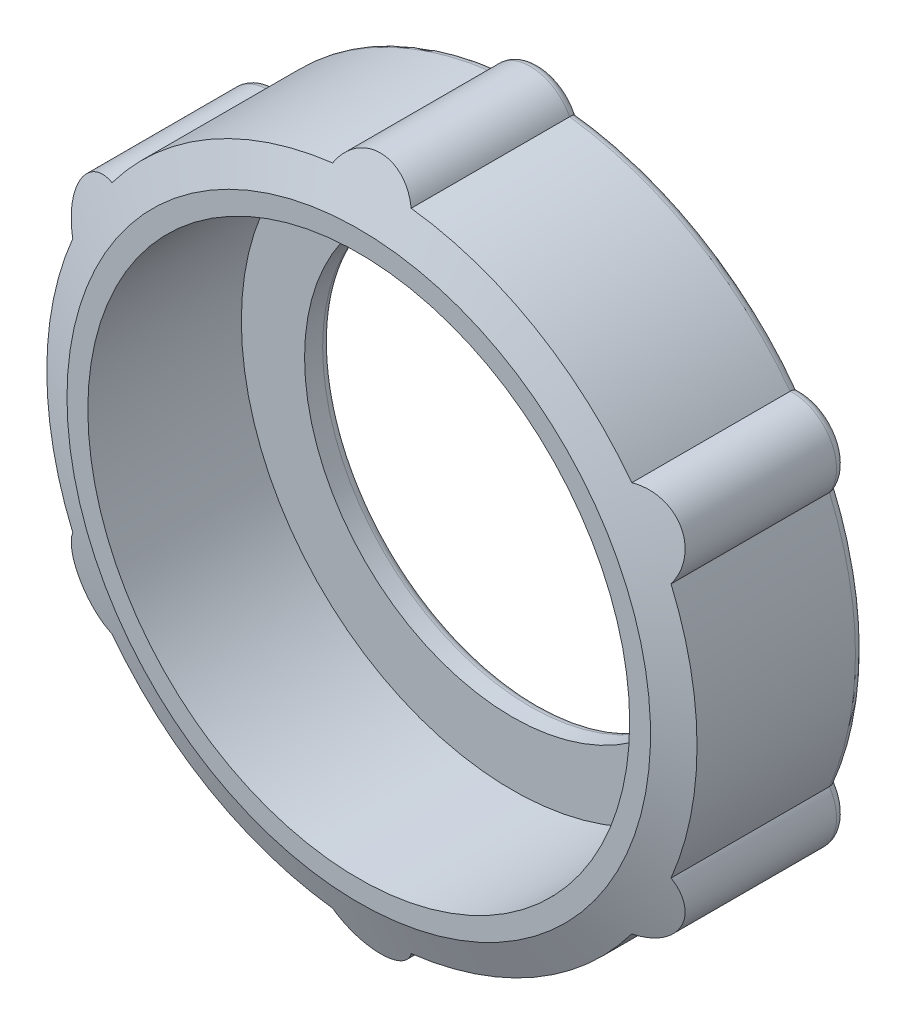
ISO-10303-21;
HEADER;
FILE_DESCRIPTION(('STEP AP214'),'2;1');
FILE_NAME('part.step','',(''),(''),'','','');
FILE_SCHEMA(('AUTOMOTIVE_DESIGN { 1 0 10303 214 1 1 1 1 }'));
ENDSEC;
DATA;
#1=APPLICATION_CONTEXT('core data for automotive mechanical design processes');
#2=APPLICATION_PROTOCOL_DEFINITION('international standard','automotive_design',2000,#1);
#3=PRODUCT_CONTEXT('',#1,'mechanical');
#4=PRODUCT('Part','Part','',(#3));
#5=PRODUCT_RELATED_PRODUCT_CATEGORY('part','',(#4));
#6=PRODUCT_DEFINITION_FORMATION('','',#4);
#7=PRODUCT_DEFINITION_CONTEXT('part definition',#1,'design');
#8=PRODUCT_DEFINITION('design','',#6,#7);
#9=PRODUCT_DEFINITION_SHAPE('','',#8);
#10=(LENGTH_UNIT() NAMED_UNIT(*) SI_UNIT(.MILLI.,.METRE.));
#11=(NAMED_UNIT(*) PLANE_ANGLE_UNIT() SI_UNIT($,.RADIAN.));
#12=(NAMED_UNIT(*) SI_UNIT($,.STERADIAN.) SOLID_ANGLE_UNIT());
#13=UNCERTAINTY_MEASURE_WITH_UNIT(LENGTH_MEASURE(1.E-05),#10,'distance_accuracy_value','');
#14=(GEOMETRIC_REPRESENTATION_CONTEXT(3) GLOBAL_UNCERTAINTY_ASSIGNED_CONTEXT((#13)) GLOBAL_UNIT_ASSIGNED_CONTEXT((#10,
#11,#12)) REPRESENTATION_CONTEXT('',''));
#15=CARTESIAN_POINT('',(0.,0.,0.));
#16=DIRECTION('',(0.,0.,1.));
#17=DIRECTION('',(1.,0.,0.));
#18=AXIS2_PLACEMENT_3D('',#15,#16,#17);
#19=CARTESIAN_POINT('',(0.,0.,20.));
#20=DIRECTION('',(0.,0.,-1.));
#21=DIRECTION('',(-1.,0.,0.));
#22=AXIS2_PLACEMENT_3D('',#19,#20,#21);
#23=CYLINDRICAL_SURFACE('',#22,36.);
#24=DIRECTION('',(0.,0.,-1.));
#25=VECTOR('',#24,1.);
#26=CARTESIAN_POINT('',(-4.34737421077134,35.7365406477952,10.));
#27=LINE('',#26,#25);
#28=CARTESIAN_POINT('',(-4.34737421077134,35.7365406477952,0.999999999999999));
#29=VERTEX_POINT('',#28);
#30=CARTESIAN_POINT('',(-4.34737421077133,35.7365406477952,18.5421406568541));
#31=VERTEX_POINT('',#30);
#32=EDGE_CURVE('E279',#29,#31,#27,.F.);
#33=ORIENTED_EDGE('',*,*,#32,.F.);
#34=CARTESIAN_POINT('',(0.,0.,1.));
#35=DIRECTION('',(0.,0.,1.));
#36=DIRECTION('',(1.,0.,0.));
#37=AXIS2_PLACEMENT_3D('',#34,#35,#36);
#38=CIRCLE('',#37,36.);
#39=CARTESIAN_POINT('',(-28.7755752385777,21.6325280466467,0.999999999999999));
#40=VERTEX_POINT('',#39);
#41=EDGE_CURVE('E50',#29,#40,#38,.T.);
#42=ORIENTED_EDGE('',*,*,#41,.T.);
#43=DIRECTION('',(0.,0.,-1.));
#44=VECTOR('',#43,1.);
#45=CARTESIAN_POINT('',(-28.7755752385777,21.6325280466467,10.));
#46=LINE('',#45,#44);
#47=CARTESIAN_POINT('',(-28.7755752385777,21.6325280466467,18.5421406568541));
#48=VERTEX_POINT('',#47);
#49=EDGE_CURVE('E158',#48,#40,#46,.T.);
#50=ORIENTED_EDGE('',*,*,#49,.F.);
#51=CARTESIAN_POINT('',(0.,0.,18.5421406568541));
#52=DIRECTION('',(0.,0.,-1.));
#53=DIRECTION('',(-1.,0.,0.));
#54=AXIS2_PLACEMENT_3D('',#51,#52,#53);
#55=CIRCLE('',#54,36.);
#56=EDGE_CURVE('E169',#31,#48,#55,.F.);
#57=ORIENTED_EDGE('',*,*,#56,.F.);
#58=EDGE_LOOP('',(#33,#42,#50,#57));
#59=FACE_BOUND('',#58,.T.);
#60=ADVANCED_FACE('F29',(#59),#23,.T.);
#61=DIRECTION('',(0.,0.,-1.));
#62=VECTOR('',#61,1.);
#63=CARTESIAN_POINT('',(-33.1224391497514,14.1033338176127,10.));
#64=LINE('',#63,#62);
#65=CARTESIAN_POINT('',(-33.1224391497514,14.1033338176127,0.999999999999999));
#66=VERTEX_POINT('',#65);
#67=CARTESIAN_POINT('',(-33.1224391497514,14.1033338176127,18.5421406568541));
#68=VERTEX_POINT('',#67);
#69=EDGE_CURVE('E151',#66,#68,#64,.F.);
#70=ORIENTED_EDGE('',*,*,#69,.F.);
#71=CARTESIAN_POINT('',(0.,0.,1.));
#72=DIRECTION('',(0.,0.,1.));
#73=DIRECTION('',(1.,0.,0.));
#74=AXIS2_PLACEMENT_3D('',#71,#72,#73);
#75=CIRCLE('',#74,36.);
#76=CARTESIAN_POINT('',(-33.1221064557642,-14.1041151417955,0.999999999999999));
#77=VERTEX_POINT('',#76);
#78=EDGE_CURVE('E11',#66,#77,#75,.T.);
#79=ORIENTED_EDGE('',*,*,#78,.T.);
#80=DIRECTION('',(0.,0.,-1.));
#81=VECTOR('',#80,1.);
#82=CARTESIAN_POINT('',(-33.1221064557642,-14.1041151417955,10.));
#83=LINE('',#82,#81);
#84=CARTESIAN_POINT('',(-33.1221064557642,-14.1041151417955,18.5421406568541));
#85=VERTEX_POINT('',#84);
#86=EDGE_CURVE('E176',#85,#77,#83,.T.);
#87=ORIENTED_EDGE('',*,*,#86,.F.);
#88=CARTESIAN_POINT('',(0.,0.,18.5421406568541));
#89=DIRECTION('',(0.,0.,-1.));
#90=DIRECTION('',(-1.,0.,0.));
#91=AXIS2_PLACEMENT_3D('',#88,#89,#90);
#92=CIRCLE('',#91,36.);
#93=EDGE_CURVE('E165',#68,#85,#92,.F.);
#94=ORIENTED_EDGE('',*,*,#93,.F.);
#95=EDGE_LOOP('',(#70,#79,#87,#94));
#96=FACE_BOUND('',#95,.T.);
#97=ADVANCED_FACE('F174',(#96),#23,.T.);
#98=DIRECTION('',(0.,0.,-1.));
#99=VECTOR('',#98,1.);
#100=CARTESIAN_POINT('',(-28.7750649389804,-21.6332068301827,10.));
#101=LINE('',#100,#99);
#102=CARTESIAN_POINT('',(-28.7750649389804,-21.6332068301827,0.999999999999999));
#103=VERTEX_POINT('',#102);
#104=CARTESIAN_POINT('',(-28.7750649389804,-21.6332068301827,18.5421406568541));
#105=VERTEX_POINT('',#104);
#106=EDGE_CURVE('E497',#103,#105,#101,.F.);
#107=ORIENTED_EDGE('',*,*,#106,.F.);
#108=CARTESIAN_POINT('',(0.,0.,1.));
#109=DIRECTION('',(0.,0.,1.));
#110=DIRECTION('',(1.,0.,0.));
#111=AXIS2_PLACEMENT_3D('',#108,#109,#110);
#112=CIRCLE('',#111,36.);
#113=CARTESIAN_POINT('',(-4.34653121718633,-35.7366431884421,0.999999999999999));
#114=VERTEX_POINT('',#113);
#115=EDGE_CURVE('E318',#103,#114,#112,.T.);
#116=ORIENTED_EDGE('',*,*,#115,.T.);
#117=DIRECTION('',(0.,0.,-1.));
#118=VECTOR('',#117,1.);
#119=CARTESIAN_POINT('',(-4.34653121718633,-35.7366431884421,10.));
#120=LINE('',#119,#118);
#121=CARTESIAN_POINT('',(-4.34653121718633,-35.7366431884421,18.5421406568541));
#122=VERTEX_POINT('',#121);
#123=EDGE_CURVE('E499',#122,#114,#120,.T.);
#124=ORIENTED_EDGE('',*,*,#123,.F.);
#125=CARTESIAN_POINT('',(0.,0.,18.5421406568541));
#126=DIRECTION('',(0.,0.,-1.));
#127=DIRECTION('',(-1.,0.,0.));
#128=AXIS2_PLACEMENT_3D('',#125,#126,#127);
#129=CIRCLE('',#128,36.);
#130=EDGE_CURVE('E560',#105,#122,#129,.F.);
#131=ORIENTED_EDGE('',*,*,#130,.F.);
#132=EDGE_LOOP('',(#107,#116,#124,#131));
#133=FACE_BOUND('',#132,.T.);
#134=ADVANCED_FACE('F278',(#133),#23,.T.);
#135=DIRECTION('',(0.,0.,-1.));
#136=VECTOR('',#135,1.);
#137=CARTESIAN_POINT('',(4.34737421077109,-35.7365406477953,10.));
#138=LINE('',#137,#136);
#139=CARTESIAN_POINT('',(4.34737421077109,-35.7365406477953,0.999999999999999));
#140=VERTEX_POINT('',#139);
#141=CARTESIAN_POINT('',(4.34737421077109,-35.7365406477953,18.5421406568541));
#142=VERTEX_POINT('',#141);
#143=EDGE_CURVE('E496',#140,#142,#138,.F.);
#144=ORIENTED_EDGE('',*,*,#143,.F.);
#145=CARTESIAN_POINT('',(0.,0.,1.));
#146=DIRECTION('',(0.,0.,1.));
#147=DIRECTION('',(1.,0.,0.));
#148=AXIS2_PLACEMENT_3D('',#145,#146,#147);
#149=CIRCLE('',#148,36.);
#150=CARTESIAN_POINT('',(28.7755752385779,-21.6325280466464,0.999999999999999));
#151=VERTEX_POINT('',#150);
#152=EDGE_CURVE('E314',#140,#151,#149,.T.);
#153=ORIENTED_EDGE('',*,*,#152,.T.);
#154=DIRECTION('',(0.,0.,-1.));
#155=VECTOR('',#154,1.);
#156=CARTESIAN_POINT('',(28.7755752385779,-21.6325280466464,10.));
#157=LINE('',#156,#155);
#158=CARTESIAN_POINT('',(28.7755752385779,-21.6325280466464,18.5421406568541));
#159=VERTEX_POINT('',#158);
#160=EDGE_CURVE('E508',#159,#151,#157,.T.);
#161=ORIENTED_EDGE('',*,*,#160,.F.);
#162=CARTESIAN_POINT('',(0.,0.,18.5421406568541));
#163=DIRECTION('',(0.,0.,-1.));
#164=DIRECTION('',(-1.,0.,0.));
#165=AXIS2_PLACEMENT_3D('',#162,#163,#164);
#166=CIRCLE('',#165,36.);
#167=EDGE_CURVE('E537',#142,#159,#166,.F.);
#168=ORIENTED_EDGE('',*,*,#167,.F.);
#169=EDGE_LOOP('',(#144,#153,#161,#168));
#170=FACE_BOUND('',#169,.T.);
#171=ADVANCED_FACE('F549',(#170),#23,.T.);
#172=DIRECTION('',(0.,0.,-1.));
#173=VECTOR('',#172,1.);
#174=CARTESIAN_POINT('',(33.1224391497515,-14.1033338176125,10.));
#175=LINE('',#174,#173);
#176=CARTESIAN_POINT('',(33.1224391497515,-14.1033338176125,0.999999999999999));
#177=VERTEX_POINT('',#176);
#178=CARTESIAN_POINT('',(33.1224391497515,-14.1033338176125,18.5421406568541));
#179=VERTEX_POINT('',#178);
#180=EDGE_CURVE('E506',#177,#179,#175,.F.);
#181=ORIENTED_EDGE('',*,*,#180,.F.);
#182=CARTESIAN_POINT('',(0.,0.,1.));
#183=DIRECTION('',(0.,0.,1.));
#184=DIRECTION('',(1.,0.,0.));
#185=AXIS2_PLACEMENT_3D('',#182,#183,#184);
#186=CIRCLE('',#185,36.);
#187=CARTESIAN_POINT('',(33.1221064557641,14.1041151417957,0.999999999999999));
#188=VERTEX_POINT('',#187);
#189=EDGE_CURVE('E310',#177,#188,#186,.T.);
#190=ORIENTED_EDGE('',*,*,#189,.T.);
#191=DIRECTION('',(0.,0.,-1.));
#192=VECTOR('',#191,1.);
#193=CARTESIAN_POINT('',(33.1221064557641,14.1041151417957,10.));
#194=LINE('',#193,#192);
#195=CARTESIAN_POINT('',(33.1221064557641,14.1041151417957,18.5421406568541));
#196=VERTEX_POINT('',#195);
#197=EDGE_CURVE('E283',#196,#188,#194,.T.);
#198=ORIENTED_EDGE('',*,*,#197,.F.);
#199=CARTESIAN_POINT('',(0.,0.,18.5421406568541));
#200=DIRECTION('',(0.,0.,-1.));
#201=DIRECTION('',(-1.,0.,0.));
#202=AXIS2_PLACEMENT_3D('',#199,#200,#201);
#203=CIRCLE('',#202,36.);
#204=EDGE_CURVE('E235',#179,#196,#203,.F.);
#205=ORIENTED_EDGE('',*,*,#204,.F.);
#206=EDGE_LOOP('',(#181,#190,#198,#205));
#207=FACE_BOUND('',#206,.T.);
#208=ADVANCED_FACE('F270',(#207),#23,.T.);
#209=DIRECTION('',(0.,0.,-1.));
#210=VECTOR('',#209,1.);
#211=CARTESIAN_POINT('',(28.7750649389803,21.6332068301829,10.));
#212=LINE('',#211,#210);
#213=CARTESIAN_POINT('',(28.7750649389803,21.6332068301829,0.999999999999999));
#214=VERTEX_POINT('',#213);
#215=CARTESIAN_POINT('',(28.7750649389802,21.6332068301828,18.5421406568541));
#216=VERTEX_POINT('',#215);
#217=EDGE_CURVE('E511',#214,#216,#212,.F.);
#218=ORIENTED_EDGE('',*,*,#217,.F.);
#219=CARTESIAN_POINT('',(0.,0.,1.));
#220=DIRECTION('',(0.,0.,1.));
#221=DIRECTION('',(1.,0.,0.));
#222=AXIS2_PLACEMENT_3D('',#219,#220,#221);
#223=CIRCLE('',#222,36.);
#224=CARTESIAN_POINT('',(4.34653121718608,35.7366431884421,0.999999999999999));
#225=VERTEX_POINT('',#224);
#226=EDGE_CURVE('E304',#214,#225,#223,.T.);
#227=ORIENTED_EDGE('',*,*,#226,.T.);
#228=DIRECTION('',(0.,0.,-1.));
#229=VECTOR('',#228,1.);
#230=CARTESIAN_POINT('',(4.34653121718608,35.7366431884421,10.));
#231=LINE('',#230,#229);
#232=CARTESIAN_POINT('',(4.34653121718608,35.7366431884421,18.5421406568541));
#233=VERTEX_POINT('',#232);
#234=EDGE_CURVE('E282',#233,#225,#231,.T.);
#235=ORIENTED_EDGE('',*,*,#234,.F.);
#236=CARTESIAN_POINT('',(0.,0.,18.5421406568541));
#237=DIRECTION('',(0.,0.,-1.));
#238=DIRECTION('',(-1.,0.,0.));
#239=AXIS2_PLACEMENT_3D('',#236,#237,#238);
#240=CIRCLE('',#239,36.);
#241=EDGE_CURVE('E530',#216,#233,#240,.F.);
#242=ORIENTED_EDGE('',*,*,#241,.F.);
#243=EDGE_LOOP('',(#218,#227,#235,#242));
#244=FACE_BOUND('',#243,.T.);
#245=ADVANCED_FACE('F265',(#244),#23,.T.);
#246=CARTESIAN_POINT('',(0.,0.,20.));
#247=DIRECTION('',(0.,0.,1.));
#248=DIRECTION('',(1.,0.,0.));
#249=AXIS2_PLACEMENT_3D('',#246,#247,#248);
#250=PLANE('',#249);
#251=CARTESIAN_POINT('',(0.,0.,20.));
#252=DIRECTION('',(0.,0.,1.));
#253=DIRECTION('',(1.,0.,0.));
#254=AXIS2_PLACEMENT_3D('',#251,#252,#253);
#255=CIRCLE('',#254,30.);
#256=CARTESIAN_POINT('',(30.,0.,20.));
#257=VERTEX_POINT('',#256);
#258=EDGE_CURVE('E518',#257,#257,#255,.T.);
#259=ORIENTED_EDGE('',*,*,#258,.F.);
#260=EDGE_LOOP('',(#259));
#261=FACE_BOUND('',#260,.T.);
#262=CARTESIAN_POINT('',(0.,0.,20.));
#263=DIRECTION('',(0.,0.,-1.));
#264=DIRECTION('',(-1.,0.,0.));
#265=AXIS2_PLACEMENT_3D('',#262,#263,#264);
#266=CIRCLE('',#265,32.3079538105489);
#267=CARTESIAN_POINT('',(-32.3079538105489,0.,20.));
#268=VERTEX_POINT('',#267);
#269=EDGE_CURVE('E177',#268,#268,#266,.T.);
#270=ORIENTED_EDGE('',*,*,#269,.F.);
#271=EDGE_LOOP('',(#270));
#272=FACE_BOUND('',#271,.T.);
#273=ADVANCED_FACE('F248',(#261,#272),#250,.T.);
#274=CARTESIAN_POINT('',(-0.00039529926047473,33.5154350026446,20.));
#275=DIRECTION('',(0.,0.,-1.));
#276=DIRECTION('',(-1.,0.,0.));
#277=AXIS2_PLACEMENT_3D('',#274,#275,#276);
#278=CYLINDRICAL_SURFACE('',#277,4.88155056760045);
#279=ORIENTED_EDGE('',*,*,#234,.T.);
#280=CARTESIAN_POINT('',(-0.00039529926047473,33.5154350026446,1.));
#281=DIRECTION('',(0.,0.,1.));
#282=DIRECTION('',(1.,0.,0.));
#283=AXIS2_PLACEMENT_3D('',#280,#281,#282);
#284=CIRCLE('',#283,4.88155056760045);
#285=EDGE_CURVE('E292',#225,#29,#284,.T.);
#286=ORIENTED_EDGE('',*,*,#285,.T.);
#287=ORIENTED_EDGE('',*,*,#32,.T.);
#288=CARTESIAN_POINT('',(4.34668579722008,35.7363406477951,18.5422518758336));
#289=CARTESIAN_POINT('',(4.28506337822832,35.8569847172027,18.4978999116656));
#290=CARTESIAN_POINT('',(4.21823537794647,35.9753677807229,18.4545887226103));
#291=CARTESIAN_POINT('',(4.07450402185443,36.2067645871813,18.3702932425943));
#292=CARTESIAN_POINT('',(3.99759815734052,36.3197769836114,18.3293095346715));
#293=CARTESIAN_POINT('',(3.83393943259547,36.5397102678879,18.2498694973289));
#294=CARTESIAN_POINT('',(3.7471701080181,36.6466205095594,18.2114175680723));
#295=CARTESIAN_POINT('',(3.56436496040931,36.8532553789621,18.1373707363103));
#296=CARTESIAN_POINT('',(3.46832997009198,36.9529806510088,18.1017755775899));
#297=CARTESIAN_POINT('',(3.26735614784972,37.1445735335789,18.0336173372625));
#298=CARTESIAN_POINT('',(3.16240114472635,37.2364262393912,18.0010599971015));
#299=CARTESIAN_POINT('',(2.94436015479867,37.4112642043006,17.9392724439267));
#300=CARTESIAN_POINT('',(2.83127112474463,37.4942461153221,17.9100434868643));
#301=CARTESIAN_POINT('',(2.59792459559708,37.6504018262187,17.8551829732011));
#302=CARTESIAN_POINT('',(2.47767737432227,37.7235892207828,17.8295464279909));
#303=CARTESIAN_POINT('',(2.23068609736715,37.8595910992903,17.7820116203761));
#304=CARTESIAN_POINT('',(2.10393978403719,37.9224019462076,17.7601146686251));
#305=CARTESIAN_POINT('',(1.85051800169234,38.0345081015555,17.7211027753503));
#306=CARTESIAN_POINT('',(1.72407332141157,38.084268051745,17.7038228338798));
#307=CARTESIAN_POINT('',(1.46706606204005,38.1731791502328,17.672988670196));
#308=CARTESIAN_POINT('',(1.33650360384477,38.2123306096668,17.6594343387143));
#309=CARTESIAN_POINT('',(1.07222601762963,38.2796363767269,17.6361553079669));
#310=CARTESIAN_POINT('',(0.938510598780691,38.3077896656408,17.6264309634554));
#311=CARTESIAN_POINT('',(0.668965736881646,38.3528062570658,17.6108906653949));
#312=CARTESIAN_POINT('',(0.533136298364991,38.3696695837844,17.6050747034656));
#313=CARTESIAN_POINT('',(0.266009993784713,38.3914766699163,17.5975547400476));
#314=CARTESIAN_POINT('',(0.134754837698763,38.3968795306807,17.595692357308));
#315=CARTESIAN_POINT('',(-0.127810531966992,38.397088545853,17.5956192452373));
#316=CARTESIAN_POINT('',(-0.259120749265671,38.3918911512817,17.597409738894));
#317=CARTESIAN_POINT('',(-0.520725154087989,38.3709476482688,17.6046297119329));
#318=CARTESIAN_POINT('',(-0.651019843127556,38.3552071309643,17.6100572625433));
#319=CARTESIAN_POINT('',(-0.909773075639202,38.3133252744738,17.6245120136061));
#320=CARTESIAN_POINT('',(-1.03823092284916,38.2871800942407,17.6335405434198));
#321=CARTESIAN_POINT('',(-1.29104649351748,38.2250555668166,17.6550205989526));
#322=CARTESIAN_POINT('',(-1.41543273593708,38.1891796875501,17.6674361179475));
#323=CARTESIAN_POINT('',(-1.66066599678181,38.1077910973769,17.6956466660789));
#324=CARTESIAN_POINT('',(-1.78151171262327,38.0622748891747,17.7114429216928));
#325=CARTESIAN_POINT('',(-2.01878017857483,37.9620334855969,17.746297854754));
#326=CARTESIAN_POINT('',(-2.13520449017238,37.907311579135,17.765355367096));
#327=CARTESIAN_POINT('',(-2.36297954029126,37.7890991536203,17.8066159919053));
#328=CARTESIAN_POINT('',(-2.47432841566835,37.7256054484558,17.8288202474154));
#329=CARTESIAN_POINT('',(-2.69363035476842,37.588894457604,17.8767508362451));
#330=CARTESIAN_POINT('',(-2.80145492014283,37.5154940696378,17.9025438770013));
#331=CARTESIAN_POINT('',(-3.01043479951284,37.3607102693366,17.9570936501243));
#332=CARTESIAN_POINT('',(-3.11158735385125,37.2793235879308,17.9858515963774));
#333=CARTESIAN_POINT('',(-3.40410086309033,37.0241528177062,18.076306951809));
#334=CARTESIAN_POINT('',(-3.58471692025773,36.8392329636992,18.1422295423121));
#335=CARTESIAN_POINT('',(-3.86604730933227,36.5020491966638,18.2633756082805));
#336=CARTESIAN_POINT('',(-3.97484854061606,36.3555442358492,18.3162768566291));
#337=CARTESIAN_POINT('',(-4.17461185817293,36.0528088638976,18.4262429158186));
#338=CARTESIAN_POINT('',(-4.26561412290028,35.8966014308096,18.4832979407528));
#339=CARTESIAN_POINT('',(-4.34747639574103,35.7363406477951,18.5422141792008));
#340=B_SPLINE_CURVE_WITH_KNOTS('',3,(#288,#289,#290,#291,#292,#293,#294,#295,#296,#297,#298,
#299,#300,#301,#302,#303,#304,#305,#306,#307,#308,#309,#310,#311,#312,#313,#314,#315,#316,#317,
#318,#319,#320,#321,#322,#323,#324,#325,#326,#327,#328,#329,#330,#331,#332,#333,#334,#335,#336,
#337,#338,#339),.UNSPECIFIED.,.F.,.F.,(4,2,2,2,2,2,2,2,2,2,2,2,2,2,2,2,2,2,2,2,2,2,2,2,2,4),(0.,
0.427542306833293,0.855191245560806,1.28356481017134,1.71189991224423,2.14102882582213,
2.57031913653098,2.99900727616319,3.42784535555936,3.83826395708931,4.24867052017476,
4.65911508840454,5.06955877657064,5.46322309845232,5.85701924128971,6.25060671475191,
6.64433962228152,7.03403977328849,7.42388154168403,7.81358432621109,8.20342903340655,
8.60184551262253,9.00042576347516,9.79687663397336,10.3658386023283,10.9335010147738),.UNSPECIFIED.);
#341=EDGE_CURVE('E192',#233,#31,#340,.T.);
#342=ORIENTED_EDGE('',*,*,#341,.F.);
#343=EDGE_LOOP('',(#279,#286,#287,#342));
#344=FACE_BOUND('',#343,.T.);
#345=ADVANCED_FACE('F242',(#344),#278,.T.);
#346=CARTESIAN_POINT('',(29.0250204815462,16.7580598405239,20.));
#347=DIRECTION('',(0.,0.,-1.));
#348=DIRECTION('',(-1.,0.,0.));
#349=AXIS2_PLACEMENT_3D('',#346,#347,#348);
#350=CYLINDRICAL_SURFACE('',#349,4.88155056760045);
#351=ORIENTED_EDGE('',*,*,#197,.T.);
#352=CARTESIAN_POINT('',(29.0250204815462,16.7580598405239,1.));
#353=DIRECTION('',(0.,0.,1.));
#354=DIRECTION('',(1.,0.,0.));
#355=AXIS2_PLACEMENT_3D('',#352,#353,#354);
#356=CIRCLE('',#355,4.88155056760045);
#357=EDGE_CURVE('E308',#188,#214,#356,.T.);
#358=ORIENTED_EDGE('',*,*,#357,.T.);
#359=ORIENTED_EDGE('',*,*,#217,.T.);
#360=CARTESIAN_POINT('',(33.121976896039,14.1039151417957,18.5422186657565));
#361=CARTESIAN_POINT('',(33.1956439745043,14.2176050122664,18.4978673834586));
#362=CARTESIAN_POINT('',(33.2647501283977,14.3346724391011,18.4545569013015));
#363=CARTESIAN_POINT('',(33.3932747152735,14.5748479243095,18.3702628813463));
#364=CARTESIAN_POINT('',(33.452690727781,14.6979574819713,18.3292799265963));
#365=CARTESIAN_POINT('',(33.5613237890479,14.9496583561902,18.2498414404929));
#366=CARTESIAN_POINT('',(33.6105233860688,15.0782586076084,18.2113903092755));
#367=CARTESIAN_POINT('',(33.698066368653,15.339891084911,18.1373451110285));
#368=CARTESIAN_POINT('',(33.7364107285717,15.4729229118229,18.1017507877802));
#369=CARTESIAN_POINT('',(33.8018425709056,15.7427684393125,18.0335942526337));
#370=CARTESIAN_POINT('',(33.8289090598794,15.8795886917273,18.0010377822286));
#371=CARTESIAN_POINT('',(33.8712971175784,16.1558368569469,17.9392519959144));
#372=CARTESIAN_POINT('',(33.8866142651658,16.2952657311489,17.910023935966));
#373=CARTESIAN_POINT('',(33.9051702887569,16.5754272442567,17.8551652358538));
#374=CARTESIAN_POINT('',(33.9084260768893,16.7161577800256,17.8295296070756));
#375=CARTESIAN_POINT('',(33.9027060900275,16.9980585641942,17.7819966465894));
#376=CARTESIAN_POINT('',(33.8937260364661,17.1392289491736,17.760100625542));
#377=CARTESIAN_POINT('',(33.8640967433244,17.4147504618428,17.7210905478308));
#378=CARTESIAN_POINT('',(33.8439652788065,17.5491340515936,17.703811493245));
#379=CARTESIAN_POINT('',(33.7924559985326,17.8161628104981,17.6729791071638));
#380=CARTESIAN_POINT('',(33.7610785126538,17.9488080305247,17.6594256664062));
#381=CARTESIAN_POINT('',(33.6872235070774,18.2113299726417,17.6361484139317));
#382=CARTESIAN_POINT('',(33.6447449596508,18.3412064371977,17.6264249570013));
#383=CARTESIAN_POINT('',(33.5489535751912,18.5971449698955,17.6108864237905));
#384=CARTESIAN_POINT('',(33.4956407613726,18.7232070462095,17.6050713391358));
#385=CARTESIAN_POINT('',(33.3809589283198,18.9654461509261,17.5975530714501));
#386=CARTESIAN_POINT('',(33.3200083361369,19.0818166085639,17.5956915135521));
#387=CARTESIAN_POINT('',(33.1889027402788,19.3093066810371,17.5956200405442));
#388=CARTESIAN_POINT('',(33.1187446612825,19.4204245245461,17.5974113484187));
#389=CARTESIAN_POINT('',(32.9698012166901,19.636505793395,17.6046329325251));
#390=CARTESIAN_POINT('',(32.8910204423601,19.7414724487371,17.6100612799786));
#391=CARTESIAN_POINT('',(32.7253697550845,19.9446150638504,17.6245176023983));
#392=CARTESIAN_POINT('',(32.6384968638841,20.0427885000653,17.6335469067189));
#393=CARTESIAN_POINT('',(32.4582845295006,20.2306675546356,17.6550284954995));
#394=CARTESIAN_POINT('',(32.3650204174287,20.3204495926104,17.6674447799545));
#395=CARTESIAN_POINT('',(32.1719162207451,20.4921300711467,17.6956568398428));
#396=CARTESIAN_POINT('',(32.0720737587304,20.5740256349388,17.7114538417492));
#397=CARTESIAN_POINT('',(31.8666252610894,20.7293817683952,17.7463102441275));
#398=CARTESIAN_POINT('',(31.761021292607,20.8028453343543,17.7653684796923));
#399=CARTESIAN_POINT('',(31.5447564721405,20.9409942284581,17.8066305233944));
#400=CARTESIAN_POINT('',(31.4340937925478,21.0056763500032,17.828835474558));
#401=CARTESIAN_POINT('',(31.2060454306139,21.1272379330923,17.8767674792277));
#402=CARTESIAN_POINT('',(31.0885654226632,21.1839145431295,17.9025612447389));
#403=CARTESIAN_POINT('',(30.8500267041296,21.2875004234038,17.9571124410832));
#404=CARTESIAN_POINT('',(30.7289665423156,21.3344056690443,17.9858710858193));
#405=CARTESIAN_POINT('',(30.3617228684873,21.4601380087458,18.0763284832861));
#406=CARTESIAN_POINT('',(30.1112682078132,21.5240917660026,18.1422523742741));
#407=CARTESIAN_POINT('',(29.6786103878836,21.5991282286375,18.2633952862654));
#408=CARTESIAN_POINT('',(29.4973511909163,21.6200960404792,18.3162916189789));
#409=CARTESIAN_POINT('',(29.1353299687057,21.6417239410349,18.4262469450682));
#410=CARTESIAN_POINT('',(28.9545677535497,21.6424303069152,18.483296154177));
#411=CARTESIAN_POINT('',(28.7748649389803,21.6331965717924,18.542206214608));
#412=B_SPLINE_CURVE_WITH_KNOTS('',3,(#360,#361,#362,#363,#364,#365,#366,#367,#368,#369,#370,
#371,#372,#373,#374,#375,#376,#377,#378,#379,#380,#381,#382,#383,#384,#385,#386,#387,#388,#389,
#390,#391,#392,#393,#394,#395,#396,#397,#398,#399,#400,#401,#402,#403,#404,#405,#406,#407,#408,
#409,#410,#411),.UNSPECIFIED.,.F.,.F.,(4,2,2,2,2,2,2,2,2,2,2,2,2,2,2,2,2,2,2,2,2,2,2,2,2,4),(0.,
0.427540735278,0.855188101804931,1.28356007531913,1.71189358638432,2.14102090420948,
2.57030961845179,2.99899616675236,3.42783265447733,3.83824999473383,4.24865529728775,
4.65909860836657,5.06954104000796,5.46320477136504,5.85700032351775,6.25058720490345,
6.64431952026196,7.03401980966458,7.42386171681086,7.8135646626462,8.20340953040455,
8.60182684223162,9.00040792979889,9.79686032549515,10.3657643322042,10.9333688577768),.UNSPECIFIED.);
#413=EDGE_CURVE('E228',#196,#216,#412,.T.);
#414=ORIENTED_EDGE('',*,*,#413,.F.);
#415=EDGE_LOOP('',(#351,#358,#359,#414));
#416=FACE_BOUND('',#415,.T.);
#417=ADVANCED_FACE('F237',(#416),#350,.T.);
#418=CARTESIAN_POINT('',(29.0254157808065,-16.7573751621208,20.));
#419=DIRECTION('',(0.,0.,-1.));
#420=DIRECTION('',(-1.,0.,0.));
#421=AXIS2_PLACEMENT_3D('',#418,#419,#420);
#422=CYLINDRICAL_SURFACE('',#421,4.88155056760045);
#423=ORIENTED_EDGE('',*,*,#160,.T.);
#424=CARTESIAN_POINT('',(29.0254157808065,-16.7573751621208,1.));
#425=DIRECTION('',(0.,0.,1.));
#426=DIRECTION('',(1.,0.,0.));
#427=AXIS2_PLACEMENT_3D('',#424,#425,#426);
#428=CIRCLE('',#427,4.88155056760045);
#429=EDGE_CURVE('E312',#151,#177,#428,.T.);
#430=ORIENTED_EDGE('',*,*,#429,.T.);
#431=ORIENTED_EDGE('',*,*,#180,.T.);
#432=CARTESIAN_POINT('',(28.7753752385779,-21.6325177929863,18.5422062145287));
#433=CARTESIAN_POINT('',(28.9106670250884,-21.6394693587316,18.4978551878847));
#434=CARTESIAN_POINT('',(29.0466033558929,-21.6407822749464,18.4545449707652));
#435=CARTESIAN_POINT('',(29.318863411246,-21.6319979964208,18.3702514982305));
#436=CARTESIAN_POINT('',(29.4551872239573,-21.6218979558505,18.3292688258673));
#437=CARTESIAN_POINT('',(29.7274826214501,-21.5901244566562,18.249830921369));
#438=CARTESIAN_POINT('',(29.8634532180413,-21.5684314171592,18.2113800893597));
#439=CARTESIAN_POINT('',(30.1338044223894,-21.5134276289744,18.1373355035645));
#440=CARTESIAN_POINT('',(30.2681851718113,-21.4801179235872,18.1017414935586));
#441=CARTESIAN_POINT('',(30.5345933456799,-21.4018588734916,18.0335855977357));
#442=CARTESIAN_POINT('',(30.6666159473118,-21.3568880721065,18.0010294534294));
#443=CARTESIAN_POINT('',(30.9270469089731,-21.2554712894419,17.9392443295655));
#444=CARTESIAN_POINT('',(31.0554538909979,-21.199020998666,17.9100166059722));
#445=CARTESIAN_POINT('',(31.3073577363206,-21.0750085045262,17.8551585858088));
#446=CARTESIAN_POINT('',(31.4308612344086,-21.0074619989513,17.8295233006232));
#447=CARTESIAN_POINT('',(31.6721331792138,-20.8615563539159,17.7819910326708));
#448=CARTESIAN_POINT('',(31.7898996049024,-20.7831934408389,17.760095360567));
#449=CARTESIAN_POINT('',(32.0136922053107,-20.6197715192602,17.7210859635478));
#450=CARTESIAN_POINT('',(32.120005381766,-20.5351446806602,17.7038072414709));
#451=CARTESIAN_POINT('',(32.3255029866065,-20.3570206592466,17.6729755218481));
#452=CARTESIAN_POINT('',(32.4246876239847,-20.2635237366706,17.6594224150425));
#453=CARTESIAN_POINT('',(32.6151092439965,-20.0683013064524,17.6361458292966));
#454=CARTESIAN_POINT('',(32.7063454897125,-19.966575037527,17.6264227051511));
#455=CARTESIAN_POINT('',(32.880097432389,-19.7556470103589,17.6108848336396));
#456=CARTESIAN_POINT('',(32.9626131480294,-19.64644526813,17.6050700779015));
#457=CARTESIAN_POINT('',(33.1150558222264,-19.4260074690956,17.5975524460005));
#458=CARTESIAN_POINT('',(33.1853595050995,-19.3150370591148,17.5956911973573));
#459=CARTESIAN_POINT('',(33.3168172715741,-19.0877504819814,17.5956203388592));
#460=CARTESIAN_POINT('',(33.3779682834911,-18.971432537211,17.5974119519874));
#461=CARTESIAN_POINT('',(33.4906267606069,-18.7344024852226,17.6046341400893));
#462=CARTESIAN_POINT('',(33.5421393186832,-18.613692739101,17.6100627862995));
#463=CARTESIAN_POINT('',(33.6352389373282,-18.3686632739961,17.6245196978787));
#464=CARTESIAN_POINT('',(33.6768223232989,-18.2443422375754,17.6335492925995));
#465=CARTESIAN_POINT('',(33.7494225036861,-17.9943338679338,17.6550314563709));
#466=CARTESIAN_POINT('',(33.780543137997,-17.8686735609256,17.6674480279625));
#467=CARTESIAN_POINT('',(33.8326690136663,-17.6155998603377,17.6956606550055));
#468=CARTESIAN_POINT('',(33.8536705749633,-17.4881858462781,17.7114579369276));
#469=CARTESIAN_POINT('',(33.8854869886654,-17.232583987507,17.7463148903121));
#470=CARTESIAN_POINT('',(33.8963054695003,-17.1043964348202,17.7653733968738));
#471=CARTESIAN_POINT('',(33.9078118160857,-16.8480311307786,17.8066359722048));
#472=CARTESIAN_POINT('',(33.908495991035,-16.7198533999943,17.8288411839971));
#473=CARTESIAN_POINT('',(33.899745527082,-16.4615769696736,17.8767737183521));
#474=CARTESIAN_POINT('',(33.8900880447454,-16.3314980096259,17.9025677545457));
#475=CARTESIAN_POINT('',(33.8605249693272,-16.0731245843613,17.9571194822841));
#476=CARTESIAN_POINT('',(33.8406151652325,-15.9448308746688,17.9858783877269));
#477=CARTESIAN_POINT('',(33.7658781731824,-15.563922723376,18.0763365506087));
#478=CARTESIAN_POINT('',(33.6960347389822,-15.3150461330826,18.1422609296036));
#479=CARTESIAN_POINT('',(33.5446862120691,-14.9028353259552,18.2634048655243));
#480=CARTESIAN_POINT('',(33.4722137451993,-14.7353760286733,18.3163017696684));
#481=CARTESIAN_POINT('',(33.3099302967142,-14.4110420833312,18.4262582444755));
#482=CARTESIAN_POINT('',(33.2201592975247,-14.2541441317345,18.4833080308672));
#483=CARTESIAN_POINT('',(33.1223095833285,-14.1031338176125,18.5422186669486));
#484=B_SPLINE_CURVE_WITH_KNOTS('',3,(#432,#433,#434,#435,#436,#437,#438,#439,#440,#441,#442,
#443,#444,#445,#446,#447,#448,#449,#450,#451,#452,#453,#454,#455,#456,#457,#458,#459,#460,#461,
#462,#463,#464,#465,#466,#467,#468,#469,#470,#471,#472,#473,#474,#475,#476,#477,#478,#479,#480,
#481,#482,#483),.UNSPECIFIED.,.F.,.F.,(4,2,2,2,2,2,2,2,2,2,2,2,2,2,2,2,2,2,2,2,2,2,2,2,2,4),(0.,
0.427540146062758,0.855186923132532,1.28355830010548,1.71189121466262,2.14101793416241,
2.57030604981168,2.99899200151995,3.42782789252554,3.83824476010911,4.24864959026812,
4.65909242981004,5.0695343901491,5.46319789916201,5.85699322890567,6.25057988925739,
6.64431198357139,7.03401232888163,7.42385429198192,7.81355729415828,8.20340221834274,
8.60181982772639,9.00040121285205,9.79685421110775,10.3657612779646,10.9333688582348),.UNSPECIFIED.);
#485=EDGE_CURVE('E159',#159,#179,#484,.T.);
#486=ORIENTED_EDGE('',*,*,#485,.F.);
#487=EDGE_LOOP('',(#423,#430,#431,#486));
#488=FACE_BOUND('',#487,.T.);
#489=ADVANCED_FACE('F241',(#488),#422,.T.);
#490=CARTESIAN_POINT('',(0.000395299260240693,-33.5154350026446,20.));
#491=DIRECTION('',(0.,0.,-1.));
#492=DIRECTION('',(-1.,0.,0.));
#493=AXIS2_PLACEMENT_3D('',#490,#491,#492);
#494=CYLINDRICAL_SURFACE('',#493,4.88155056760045);
#495=ORIENTED_EDGE('',*,*,#123,.T.);
#496=CARTESIAN_POINT('',(0.000395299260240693,-33.5154350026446,1.));
#497=DIRECTION('',(0.,0.,1.));
#498=DIRECTION('',(1.,0.,0.));
#499=AXIS2_PLACEMENT_3D('',#496,#497,#498);
#500=CIRCLE('',#499,4.88155056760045);
#501=EDGE_CURVE('E316',#114,#140,#500,.T.);
#502=ORIENTED_EDGE('',*,*,#501,.T.);
#503=ORIENTED_EDGE('',*,*,#143,.T.);
#504=CARTESIAN_POINT('',(-4.3466857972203,-35.7363406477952,18.5422518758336));
#505=CARTESIAN_POINT('',(-4.28506337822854,-35.8569847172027,18.4978999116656));
#506=CARTESIAN_POINT('',(-4.21823537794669,-35.9753677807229,18.4545887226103));
#507=CARTESIAN_POINT('',(-4.07450402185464,-36.2067645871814,18.3702932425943));
#508=CARTESIAN_POINT('',(-3.99759815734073,-36.3197769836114,18.3293095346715));
#509=CARTESIAN_POINT('',(-3.83393943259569,-36.5397102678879,18.2498694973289));
#510=CARTESIAN_POINT('',(-3.74717010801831,-36.6466205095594,18.2114175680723));
#511=CARTESIAN_POINT('',(-3.56436496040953,-36.8532553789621,18.1373707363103));
#512=CARTESIAN_POINT('',(-3.46832997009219,-36.9529806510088,18.1017755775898));
#513=CARTESIAN_POINT('',(-3.26735614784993,-37.1445735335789,18.0336173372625));
#514=CARTESIAN_POINT('',(-3.16240114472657,-37.2364262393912,18.0010599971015));
#515=CARTESIAN_POINT('',(-2.94436015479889,-37.4112642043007,17.9392724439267));
#516=CARTESIAN_POINT('',(-2.83127112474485,-37.4942461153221,17.9100434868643));
#517=CARTESIAN_POINT('',(-2.59792459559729,-37.6504018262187,17.855182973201));
#518=CARTESIAN_POINT('',(-2.47767737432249,-37.7235892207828,17.8295464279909));
#519=CARTESIAN_POINT('',(-2.23068609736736,-37.8595910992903,17.7820116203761));
#520=CARTESIAN_POINT('',(-2.1039397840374,-37.9224019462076,17.7601146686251));
#521=CARTESIAN_POINT('',(-1.85051800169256,-38.0345081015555,17.7211027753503));
#522=CARTESIAN_POINT('',(-1.72407332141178,-38.0842680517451,17.7038228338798));
#523=CARTESIAN_POINT('',(-1.46706606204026,-38.1731791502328,17.672988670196));
#524=CARTESIAN_POINT('',(-1.33650360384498,-38.2123306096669,17.6594343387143));
#525=CARTESIAN_POINT('',(-1.07222601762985,-38.2796363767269,17.6361553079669));
#526=CARTESIAN_POINT('',(-0.938510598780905,-38.3077896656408,17.6264309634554));
#527=CARTESIAN_POINT('',(-0.668965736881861,-38.3528062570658,17.6108906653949));
#528=CARTESIAN_POINT('',(-0.533136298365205,-38.3696695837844,17.6050747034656));
#529=CARTESIAN_POINT('',(-0.266009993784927,-38.3914766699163,17.5975547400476));
#530=CARTESIAN_POINT('',(-0.134754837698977,-38.3968795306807,17.595692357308));
#531=CARTESIAN_POINT('',(0.127810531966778,-38.397088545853,17.5956192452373));
#532=CARTESIAN_POINT('',(0.259120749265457,-38.3918911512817,17.597409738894));
#533=CARTESIAN_POINT('',(0.520725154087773,-38.3709476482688,17.6046297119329));
#534=CARTESIAN_POINT('',(0.651019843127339,-38.3552071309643,17.6100572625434));
#535=CARTESIAN_POINT('',(0.909773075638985,-38.3133252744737,17.6245120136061));
#536=CARTESIAN_POINT('',(1.03823092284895,-38.2871800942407,17.6335405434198));
#537=CARTESIAN_POINT('',(1.29104649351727,-38.2250555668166,17.6550205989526));
#538=CARTESIAN_POINT('',(1.41543273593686,-38.1891796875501,17.6674361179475));
#539=CARTESIAN_POINT('',(1.6606659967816,-38.1077910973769,17.6956466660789));
#540=CARTESIAN_POINT('',(1.78151171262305,-38.0622748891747,17.7114429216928));
#541=CARTESIAN_POINT('',(2.01878017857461,-37.9620334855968,17.746297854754));
#542=CARTESIAN_POINT('',(2.13520449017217,-37.907311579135,17.765355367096));
#543=CARTESIAN_POINT('',(2.36297954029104,-37.7890991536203,17.8066159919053));
#544=CARTESIAN_POINT('',(2.47432841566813,-37.7256054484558,17.8288202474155));
#545=CARTESIAN_POINT('',(2.6936303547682,-37.588894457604,17.8767508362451));
#546=CARTESIAN_POINT('',(2.80145492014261,-37.5154940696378,17.9025438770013));
#547=CARTESIAN_POINT('',(3.01043479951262,-37.3607102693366,17.9570936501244));
#548=CARTESIAN_POINT('',(3.11158735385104,-37.2793235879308,17.9858515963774));
#549=CARTESIAN_POINT('',(3.40410086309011,-37.0241528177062,18.076306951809));
#550=CARTESIAN_POINT('',(3.58471692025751,-36.8392329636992,18.1422295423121));
#551=CARTESIAN_POINT('',(3.86604730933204,-36.5020491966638,18.2633756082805));
#552=CARTESIAN_POINT('',(3.97484854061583,-36.3555442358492,18.3162768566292));
#553=CARTESIAN_POINT('',(4.17461185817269,-36.0528088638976,18.4262429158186));
#554=CARTESIAN_POINT('',(4.26561412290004,-35.8966014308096,18.4832979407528));
#555=CARTESIAN_POINT('',(4.34747639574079,-35.7363406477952,18.5422141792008));
#556=B_SPLINE_CURVE_WITH_KNOTS('',3,(#504,#505,#506,#507,#508,#509,#510,#511,#512,#513,#514,
#515,#516,#517,#518,#519,#520,#521,#522,#523,#524,#525,#526,#527,#528,#529,#530,#531,#532,#533,
#534,#535,#536,#537,#538,#539,#540,#541,#542,#543,#544,#545,#546,#547,#548,#549,#550,#551,#552,
#553,#554,#555),.UNSPECIFIED.,.F.,.F.,(4,2,2,2,2,2,2,2,2,2,2,2,2,2,2,2,2,2,2,2,2,2,2,2,2,4),(0.,
0.427542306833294,0.855191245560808,1.28356481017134,1.71189991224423,2.14102882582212,
2.57031913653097,2.99900727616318,3.42784535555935,3.8382639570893,4.24867052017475,
4.65911508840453,5.06955877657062,5.4632230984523,5.8570192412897,6.25060671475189,
6.6443396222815,7.03403977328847,7.42388154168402,7.81358432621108,8.20342903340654,
8.60184551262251,9.00042576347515,9.79687663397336,10.3658386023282,10.9335010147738),.UNSPECIFIED.);
#557=EDGE_CURVE('E222',#122,#142,#556,.T.);
#558=ORIENTED_EDGE('',*,*,#557,.F.);
#559=EDGE_LOOP('',(#495,#502,#503,#558));
#560=FACE_BOUND('',#559,.T.);
#561=ADVANCED_FACE('F556',(#560),#494,.T.);
#562=CARTESIAN_POINT('',(-29.0250204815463,-16.7580598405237,20.));
#563=DIRECTION('',(0.,0.,-1.));
#564=DIRECTION('',(-1.,0.,0.));
#565=AXIS2_PLACEMENT_3D('',#562,#563,#564);
#566=CYLINDRICAL_SURFACE('',#565,4.88155056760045);
#567=ORIENTED_EDGE('',*,*,#86,.T.);
#568=CARTESIAN_POINT('',(-29.0250204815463,-16.7580598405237,1.));
#569=DIRECTION('',(0.,0.,1.));
#570=DIRECTION('',(1.,0.,0.));
#571=AXIS2_PLACEMENT_3D('',#568,#569,#570);
#572=CIRCLE('',#571,4.88155056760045);
#573=EDGE_CURVE('E320',#77,#103,#572,.T.);
#574=ORIENTED_EDGE('',*,*,#573,.T.);
#575=ORIENTED_EDGE('',*,*,#106,.T.);
#576=CARTESIAN_POINT('',(-33.1219768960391,-14.1039151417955,18.5422186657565));
#577=CARTESIAN_POINT('',(-33.1956439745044,-14.2176050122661,18.4978673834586));
#578=CARTESIAN_POINT('',(-33.2647501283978,-14.3346724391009,18.4545569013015));
#579=CARTESIAN_POINT('',(-33.3932747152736,-14.5748479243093,18.3702628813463));
#580=CARTESIAN_POINT('',(-33.4526907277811,-14.6979574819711,18.3292799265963));
#581=CARTESIAN_POINT('',(-33.561323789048,-14.94965835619,18.2498414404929));
#582=CARTESIAN_POINT('',(-33.6105233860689,-15.0782586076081,18.2113903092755));
#583=CARTESIAN_POINT('',(-33.6980663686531,-15.3398910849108,18.1373451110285));
#584=CARTESIAN_POINT('',(-33.7364107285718,-15.4729229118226,18.1017507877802));
#585=CARTESIAN_POINT('',(-33.8018425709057,-15.7427684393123,18.0335942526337));
#586=CARTESIAN_POINT('',(-33.8289090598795,-15.8795886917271,18.0010377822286));
#587=CARTESIAN_POINT('',(-33.8712971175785,-16.1558368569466,17.9392519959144));
#588=CARTESIAN_POINT('',(-33.8866142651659,-16.2952657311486,17.910023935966));
#589=CARTESIAN_POINT('',(-33.905170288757,-16.5754272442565,17.8551652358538));
#590=CARTESIAN_POINT('',(-33.9084260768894,-16.7161577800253,17.8295296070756));
#591=CARTESIAN_POINT('',(-33.9027060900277,-16.998058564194,17.7819966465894));
#592=CARTESIAN_POINT('',(-33.8937260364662,-17.1392289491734,17.760100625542));
#593=CARTESIAN_POINT('',(-33.8640967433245,-17.4147504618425,17.7210905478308));
#594=CARTESIAN_POINT('',(-33.8439652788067,-17.5491340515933,17.703811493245));
#595=CARTESIAN_POINT('',(-33.7924559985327,-17.8161628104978,17.6729791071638));
#596=CARTESIAN_POINT('',(-33.7610785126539,-17.9488080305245,17.6594256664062));
#597=CARTESIAN_POINT('',(-33.6872235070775,-18.2113299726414,17.6361484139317));
#598=CARTESIAN_POINT('',(-33.6447449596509,-18.3412064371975,17.6264249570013));
#599=CARTESIAN_POINT('',(-33.5489535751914,-18.5971449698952,17.6108864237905));
#600=CARTESIAN_POINT('',(-33.4956407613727,-18.7232070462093,17.6050713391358));
#601=CARTESIAN_POINT('',(-33.38095892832,-18.9654461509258,17.5975530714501));
#602=CARTESIAN_POINT('',(-33.3200083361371,-19.0818166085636,17.5956915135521));
#603=CARTESIAN_POINT('',(-33.188902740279,-19.3093066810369,17.5956200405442));
#604=CARTESIAN_POINT('',(-33.1187446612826,-19.4204245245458,17.5974113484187));
#605=CARTESIAN_POINT('',(-32.9698012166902,-19.6365057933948,17.6046329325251));
#606=CARTESIAN_POINT('',(-32.8910204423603,-19.7414724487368,17.6100612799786));
#607=CARTESIAN_POINT('',(-32.7253697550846,-19.9446150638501,17.6245176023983));
#608=CARTESIAN_POINT('',(-32.6384968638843,-20.0427885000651,17.6335469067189));
#609=CARTESIAN_POINT('',(-32.4582845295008,-20.2306675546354,17.6550284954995));
#610=CARTESIAN_POINT('',(-32.3650204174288,-20.3204495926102,17.6674447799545));
#611=CARTESIAN_POINT('',(-32.1719162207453,-20.4921300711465,17.6956568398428));
#612=CARTESIAN_POINT('',(-32.0720737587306,-20.5740256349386,17.7114538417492));
#613=CARTESIAN_POINT('',(-31.8666252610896,-20.729381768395,17.7463102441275));
#614=CARTESIAN_POINT('',(-31.7610212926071,-20.8028453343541,17.7653684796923));
#615=CARTESIAN_POINT('',(-31.5447564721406,-20.9409942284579,17.8066305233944));
#616=CARTESIAN_POINT('',(-31.4340937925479,-21.005676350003,17.828835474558));
#617=CARTESIAN_POINT('',(-31.2060454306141,-21.1272379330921,17.8767674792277));
#618=CARTESIAN_POINT('',(-31.0885654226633,-21.1839145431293,17.9025612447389));
#619=CARTESIAN_POINT('',(-30.8500267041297,-21.2875004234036,17.9571124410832));
#620=CARTESIAN_POINT('',(-30.7289665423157,-21.3344056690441,17.9858710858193));
#621=CARTESIAN_POINT('',(-30.3617228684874,-21.4601380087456,18.0763284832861));
#622=CARTESIAN_POINT('',(-30.1112682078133,-21.5240917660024,18.1422523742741));
#623=CARTESIAN_POINT('',(-29.6786103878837,-21.5991282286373,18.2633952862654));
#624=CARTESIAN_POINT('',(-29.4973511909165,-21.620096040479,18.3162916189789));
#625=CARTESIAN_POINT('',(-29.1353299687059,-21.6417239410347,18.4262469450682));
#626=CARTESIAN_POINT('',(-28.9545677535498,-21.642430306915,18.483296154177));
#627=CARTESIAN_POINT('',(-28.7748649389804,-21.6331965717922,18.542206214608));
#628=B_SPLINE_CURVE_WITH_KNOTS('',3,(#576,#577,#578,#579,#580,#581,#582,#583,#584,#585,#586,
#587,#588,#589,#590,#591,#592,#593,#594,#595,#596,#597,#598,#599,#600,#601,#602,#603,#604,#605,
#606,#607,#608,#609,#610,#611,#612,#613,#614,#615,#616,#617,#618,#619,#620,#621,#622,#623,#624,
#625,#626,#627),.UNSPECIFIED.,.F.,.F.,(4,2,2,2,2,2,2,2,2,2,2,2,2,2,2,2,2,2,2,2,2,2,2,2,2,4),(0.,
0.427540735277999,0.855188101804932,1.28356007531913,1.71189358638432,2.14102090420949,
2.57030961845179,2.99899616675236,3.42783265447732,3.83824999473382,4.24865529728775,
4.65909860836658,5.06954104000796,5.46320477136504,5.85700032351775,6.25058720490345,
6.64431952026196,7.03401980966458,7.42386171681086,7.8135646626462,8.20340953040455,
8.60182684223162,9.00040792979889,9.79686032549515,10.3657643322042,10.9333688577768),.UNSPECIFIED.);
#629=EDGE_CURVE('E179',#85,#105,#628,.T.);
#630=ORIENTED_EDGE('',*,*,#629,.F.);
#631=EDGE_LOOP('',(#567,#574,#575,#630));
#632=FACE_BOUND('',#631,.T.);
#633=ADVANCED_FACE('F198',(#632),#566,.T.);
#634=CARTESIAN_POINT('',(-29.0254157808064,16.757375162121,20.));
#635=DIRECTION('',(0.,0.,-1.));
#636=DIRECTION('',(-1.,0.,0.));
#637=AXIS2_PLACEMENT_3D('',#634,#635,#636);
#638=CYLINDRICAL_SURFACE('',#637,4.88155056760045);
#639=ORIENTED_EDGE('',*,*,#49,.T.);
#640=CARTESIAN_POINT('',(-29.0254157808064,16.757375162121,1.));
#641=DIRECTION('',(0.,0.,1.));
#642=DIRECTION('',(1.,0.,0.));
#643=AXIS2_PLACEMENT_3D('',#640,#641,#642);
#644=CIRCLE('',#643,4.88155056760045);
#645=EDGE_CURVE('E36',#40,#66,#644,.T.);
#646=ORIENTED_EDGE('',*,*,#645,.T.);
#647=ORIENTED_EDGE('',*,*,#69,.T.);
#648=CARTESIAN_POINT('',(-28.7753752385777,21.6325177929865,18.5422062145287));
#649=CARTESIAN_POINT('',(-28.9106670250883,21.6394693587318,18.4978551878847));
#650=CARTESIAN_POINT('',(-29.0466033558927,21.6407822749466,18.4545449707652));
#651=CARTESIAN_POINT('',(-29.3188634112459,21.631997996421,18.3702514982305));
#652=CARTESIAN_POINT('',(-29.4551872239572,21.6218979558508,18.3292688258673));
#653=CARTESIAN_POINT('',(-29.72748262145,21.5901244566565,18.249830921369));
#654=CARTESIAN_POINT('',(-29.8634532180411,21.5684314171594,18.2113800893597));
#655=CARTESIAN_POINT('',(-30.1338044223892,21.5134276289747,18.1373355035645));
#656=CARTESIAN_POINT('',(-30.2681851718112,21.4801179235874,18.1017414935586));
#657=CARTESIAN_POINT('',(-30.5345933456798,21.4018588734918,18.0335855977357));
#658=CARTESIAN_POINT('',(-30.6666159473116,21.3568880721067,18.0010294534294));
#659=CARTESIAN_POINT('',(-30.927046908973,21.2554712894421,17.9392443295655));
#660=CARTESIAN_POINT('',(-31.0554538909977,21.1990209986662,17.9100166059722));
#661=CARTESIAN_POINT('',(-31.3073577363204,21.0750085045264,17.8551585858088));
#662=CARTESIAN_POINT('',(-31.4308612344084,21.0074619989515,17.8295233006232));
#663=CARTESIAN_POINT('',(-31.6721331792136,20.8615563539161,17.7819910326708));
#664=CARTESIAN_POINT('',(-31.7898996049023,20.7831934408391,17.760095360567));
#665=CARTESIAN_POINT('',(-32.0136922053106,20.6197715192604,17.7210859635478));
#666=CARTESIAN_POINT('',(-32.1200053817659,20.5351446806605,17.7038072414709));
#667=CARTESIAN_POINT('',(-32.3255029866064,20.3570206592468,17.6729755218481));
#668=CARTESIAN_POINT('',(-32.4246876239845,20.2635237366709,17.6594224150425));
#669=CARTESIAN_POINT('',(-32.6151092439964,20.0683013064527,17.6361458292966));
#670=CARTESIAN_POINT('',(-32.7063454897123,19.9665750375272,17.6264227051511));
#671=CARTESIAN_POINT('',(-32.8800974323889,19.7556470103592,17.6108848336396));
#672=CARTESIAN_POINT('',(-32.9626131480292,19.6464452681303,17.6050700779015));
#673=CARTESIAN_POINT('',(-33.1150558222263,19.4260074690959,17.5975524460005));
#674=CARTESIAN_POINT('',(-33.1853595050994,19.315037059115,17.5956911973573));
#675=CARTESIAN_POINT('',(-33.316817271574,19.0877504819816,17.5956203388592));
#676=CARTESIAN_POINT('',(-33.377968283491,18.9714325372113,17.5974119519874));
#677=CARTESIAN_POINT('',(-33.4906267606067,18.7344024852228,17.6046341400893));
#678=CARTESIAN_POINT('',(-33.5421393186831,18.6136927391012,17.6100627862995));
#679=CARTESIAN_POINT('',(-33.635238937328,18.3686632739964,17.6245196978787));
#680=CARTESIAN_POINT('',(-33.6768223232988,18.2443422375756,17.6335492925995));
#681=CARTESIAN_POINT('',(-33.749422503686,17.9943338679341,17.6550314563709));
#682=CARTESIAN_POINT('',(-33.7805431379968,17.8686735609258,17.6674480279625));
#683=CARTESIAN_POINT('',(-33.8326690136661,17.6155998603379,17.6956606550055));
#684=CARTESIAN_POINT('',(-33.8536705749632,17.4881858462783,17.7114579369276));
#685=CARTESIAN_POINT('',(-33.8854869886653,17.2325839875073,17.7463148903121));
#686=CARTESIAN_POINT('',(-33.8963054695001,17.1043964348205,17.7653733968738));
#687=CARTESIAN_POINT('',(-33.9078118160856,16.8480311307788,17.8066359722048));
#688=CARTESIAN_POINT('',(-33.9084959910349,16.7198533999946,17.828841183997));
#689=CARTESIAN_POINT('',(-33.8997455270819,16.4615769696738,17.8767737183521));
#690=CARTESIAN_POINT('',(-33.8900880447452,16.3314980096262,17.9025677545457));
#691=CARTESIAN_POINT('',(-33.8605249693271,16.0731245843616,17.9571194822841));
#692=CARTESIAN_POINT('',(-33.8406151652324,15.944830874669,17.9858783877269));
#693=CARTESIAN_POINT('',(-33.7658781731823,15.5639227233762,18.0763365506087));
#694=CARTESIAN_POINT('',(-33.696034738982,15.3150461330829,18.1422609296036));
#695=CARTESIAN_POINT('',(-33.544686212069,14.9028353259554,18.2634048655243));
#696=CARTESIAN_POINT('',(-33.4722137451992,14.7353760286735,18.3163017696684));
#697=CARTESIAN_POINT('',(-33.3099302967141,14.4110420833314,18.4262582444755));
#698=CARTESIAN_POINT('',(-33.2201592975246,14.2541441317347,18.4833080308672));
#699=CARTESIAN_POINT('',(-33.1223095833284,14.1031338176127,18.5422186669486));
#700=B_SPLINE_CURVE_WITH_KNOTS('',3,(#648,#649,#650,#651,#652,#653,#654,#655,#656,#657,#658,
#659,#660,#661,#662,#663,#664,#665,#666,#667,#668,#669,#670,#671,#672,#673,#674,#675,#676,#677,
#678,#679,#680,#681,#682,#683,#684,#685,#686,#687,#688,#689,#690,#691,#692,#693,#694,#695,#696,
#697,#698,#699),.UNSPECIFIED.,.F.,.F.,(4,2,2,2,2,2,2,2,2,2,2,2,2,2,2,2,2,2,2,2,2,2,2,2,2,4),(0.,
0.427540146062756,0.855186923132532,1.28355830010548,1.71189121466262,2.14101793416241,
2.57030604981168,2.99899200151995,3.42782789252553,3.8382447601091,4.24864959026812,
4.65909242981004,5.0695343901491,5.46319789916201,5.85699322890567,6.25057988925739,
6.64431198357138,7.03401232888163,7.42385429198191,7.81355729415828,8.20340221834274,
8.60181982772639,9.00040121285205,9.79685421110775,10.3657612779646,10.9333688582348),.UNSPECIFIED.);
#701=EDGE_CURVE('E154',#48,#68,#700,.T.);
#702=ORIENTED_EDGE('',*,*,#701,.F.);
#703=EDGE_LOOP('',(#639,#646,#647,#702));
#704=FACE_BOUND('',#703,.T.);
#705=ADVANCED_FACE('F153',(#704),#638,.T.);
#706=CARTESIAN_POINT('',(0.,0.,0.));
#707=DIRECTION('',(0.,0.,1.));
#708=DIRECTION('',(1.,0.,0.));
#709=AXIS2_PLACEMENT_3D('',#706,#707,#708);
#710=PLANE('',#709);
#711=CARTESIAN_POINT('',(0.,0.,0.));
#712=DIRECTION('',(0.,0.,1.));
#713=DIRECTION('',(1.,0.,0.));
#714=AXIS2_PLACEMENT_3D('',#711,#712,#713);
#715=CIRCLE('',#714,24.);
#716=CARTESIAN_POINT('',(24.,0.,0.));
#717=VERTEX_POINT('',#716);
#718=EDGE_CURVE('E323',#717,#717,#715,.T.);
#719=ORIENTED_EDGE('',*,*,#718,.T.);
#720=EDGE_LOOP('',(#719));
#721=FACE_BOUND('',#720,.T.);
#722=CARTESIAN_POINT('',(0.,0.,0.));
#723=DIRECTION('',(0.,0.,1.));
#724=DIRECTION('',(1.,0.,0.));
#725=AXIS2_PLACEMENT_3D('',#722,#723,#724);
#726=CIRCLE('',#725,35.);
#727=CARTESIAN_POINT('',(-3.65956543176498,-34.8081539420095,0.));
#728=VERTEX_POINT('',#727);
#729=CARTESIAN_POINT('',(-28.3144775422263,-20.5740215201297,0.));
#730=VERTEX_POINT('',#729);
#731=EDGE_CURVE('E329',#728,#730,#726,.F.);
#732=ORIENTED_EDGE('',*,*,#731,.T.);
#733=CARTESIAN_POINT('',(-29.0250204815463,-16.7580598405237,0.));
#734=DIRECTION('',(0.,0.,1.));
#735=DIRECTION('',(1.,0.,0.));
#736=AXIS2_PLACEMENT_3D('',#733,#734,#735);
#737=CIRCLE('',#736,3.88155056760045);
#738=CARTESIAN_POINT('',(-31.9745282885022,-14.2348003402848,0.));
#739=VERTEX_POINT('',#738);
#740=EDGE_CURVE('E326',#730,#739,#737,.F.);
#741=ORIENTED_EDGE('',*,*,#740,.T.);
#742=CARTESIAN_POINT('',(0.,0.,0.));
#743=DIRECTION('',(0.,0.,1.));
#744=DIRECTION('',(1.,0.,0.));
#745=AXIS2_PLACEMENT_3D('',#742,#743,#744);
#746=CIRCLE('',#745,35.);
#747=CARTESIAN_POINT('',(-31.9748640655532,14.2340460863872,0.));
#748=VERTEX_POINT('',#747);
#749=EDGE_CURVE('E348',#739,#748,#746,.F.);
#750=ORIENTED_EDGE('',*,*,#749,.T.);
#751=CARTESIAN_POINT('',(-29.0254157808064,16.757375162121,0.));
#752=DIRECTION('',(0.,0.,1.));
#753=DIRECTION('',(1.,0.,0.));
#754=AXIS2_PLACEMENT_3D('',#751,#752,#753);
#755=CIRCLE('',#754,3.88155056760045);
#756=CARTESIAN_POINT('',(-28.3149628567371,20.5733536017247,0.));
#757=VERTEX_POINT('',#756);
#758=EDGE_CURVE('E346',#748,#757,#755,.F.);
#759=ORIENTED_EDGE('',*,*,#758,.T.);
#760=CARTESIAN_POINT('',(0.,0.,0.));
#761=DIRECTION('',(0.,0.,1.));
#762=DIRECTION('',(1.,0.,0.));
#763=AXIS2_PLACEMENT_3D('',#760,#761,#762);
#764=CIRCLE('',#763,35.);
#765=CARTESIAN_POINT('',(-3.66038652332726,34.8080676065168,0.));
#766=VERTEX_POINT('',#765);
#767=EDGE_CURVE('E344',#757,#766,#764,.F.);
#768=ORIENTED_EDGE('',*,*,#767,.T.);
#769=CARTESIAN_POINT('',(-0.00039529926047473,33.5154350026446,0.));
#770=DIRECTION('',(0.,0.,1.));
#771=DIRECTION('',(1.,0.,0.));
#772=AXIS2_PLACEMENT_3D('',#769,#770,#771);
#773=CIRCLE('',#772,3.88155056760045);
#774=CARTESIAN_POINT('',(3.65956543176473,34.8081539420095,0.));
#775=VERTEX_POINT('',#774);
#776=EDGE_CURVE('E293',#766,#775,#773,.F.);
#777=ORIENTED_EDGE('',*,*,#776,.T.);
#778=CARTESIAN_POINT('',(0.,0.,0.));
#779=DIRECTION('',(0.,0.,1.));
#780=DIRECTION('',(1.,0.,0.));
#781=AXIS2_PLACEMENT_3D('',#778,#779,#780);
#782=CIRCLE('',#781,35.);
#783=CARTESIAN_POINT('',(28.3144775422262,20.5740215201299,0.));
#784=VERTEX_POINT('',#783);
#785=EDGE_CURVE('E341',#775,#784,#782,.F.);
#786=ORIENTED_EDGE('',*,*,#785,.T.);
#787=CARTESIAN_POINT('',(29.0250204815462,16.7580598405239,0.));
#788=DIRECTION('',(0.,0.,1.));
#789=DIRECTION('',(1.,0.,0.));
#790=AXIS2_PLACEMENT_3D('',#787,#788,#789);
#791=CIRCLE('',#790,3.88155056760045);
#792=CARTESIAN_POINT('',(31.9745282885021,14.2348003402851,0.));
#793=VERTEX_POINT('',#792);
#794=EDGE_CURVE('E339',#784,#793,#791,.F.);
#795=ORIENTED_EDGE('',*,*,#794,.T.);
#796=CARTESIAN_POINT('',(0.,0.,0.));
#797=DIRECTION('',(0.,0.,1.));
#798=DIRECTION('',(1.,0.,0.));
#799=AXIS2_PLACEMENT_3D('',#796,#797,#798);
#800=CIRCLE('',#799,35.);
#801=CARTESIAN_POINT('',(31.9748640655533,-14.2340460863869,0.));
#802=VERTEX_POINT('',#801);
#803=EDGE_CURVE('E337',#793,#802,#800,.F.);
#804=ORIENTED_EDGE('',*,*,#803,.T.);
#805=CARTESIAN_POINT('',(29.0254157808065,-16.7573751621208,0.));
#806=DIRECTION('',(0.,0.,1.));
#807=DIRECTION('',(1.,0.,0.));
#808=AXIS2_PLACEMENT_3D('',#805,#806,#807);
#809=CIRCLE('',#808,3.88155056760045);
#810=CARTESIAN_POINT('',(28.3149628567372,-20.5733536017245,0.));
#811=VERTEX_POINT('',#810);
#812=EDGE_CURVE('E335',#802,#811,#809,.F.);
#813=ORIENTED_EDGE('',*,*,#812,.T.);
#814=CARTESIAN_POINT('',(0.,0.,0.));
#815=DIRECTION('',(0.,0.,1.));
#816=DIRECTION('',(1.,0.,0.));
#817=AXIS2_PLACEMENT_3D('',#814,#815,#816);
#818=CIRCLE('',#817,35.);
#819=CARTESIAN_POINT('',(3.66038652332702,-34.8080676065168,0.));
#820=VERTEX_POINT('',#819);
#821=EDGE_CURVE('E333',#811,#820,#818,.F.);
#822=ORIENTED_EDGE('',*,*,#821,.T.);
#823=CARTESIAN_POINT('',(0.000395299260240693,-33.5154350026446,0.));
#824=DIRECTION('',(0.,0.,1.));
#825=DIRECTION('',(1.,0.,0.));
#826=AXIS2_PLACEMENT_3D('',#823,#824,#825);
#827=CIRCLE('',#826,3.88155056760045);
#828=EDGE_CURVE('E331',#820,#728,#827,.F.);
#829=ORIENTED_EDGE('',*,*,#828,.T.);
#830=EDGE_LOOP('',(#732,#741,#750,#759,#768,#777,#786,#795,#804,#813,#822,#829));
#831=FACE_BOUND('',#830,.T.);
#832=ADVANCED_FACE('F258',(#721,#831),#710,.F.);
#833=CARTESIAN_POINT('',(0.,0.,3.));
#834=DIRECTION('',(0.,0.,1.));
#835=DIRECTION('',(1.,0.,0.));
#836=AXIS2_PLACEMENT_3D('',#833,#834,#835);
#837=CYLINDRICAL_SURFACE('',#836,30.);
#838=CARTESIAN_POINT('',(0.,0.,3.));
#839=DIRECTION('',(0.,0.,1.));
#840=DIRECTION('',(1.,0.,0.));
#841=AXIS2_PLACEMENT_3D('',#838,#839,#840);
#842=CIRCLE('',#841,30.);
#843=CARTESIAN_POINT('',(30.,0.,3.));
#844=VERTEX_POINT('',#843);
#845=EDGE_CURVE('E171',#844,#844,#842,.T.);
#846=ORIENTED_EDGE('',*,*,#845,.F.);
#847=EDGE_LOOP('',(#846));
#848=FACE_BOUND('',#847,.T.);
#849=ORIENTED_EDGE('',*,*,#258,.T.);
#850=EDGE_LOOP('',(#849));
#851=FACE_BOUND('',#850,.T.);
#852=ADVANCED_FACE('F254',(#848,#851),#837,.F.);
#853=CARTESIAN_POINT('',(0.,0.,3.));
#854=DIRECTION('',(0.,0.,1.));
#855=DIRECTION('',(1.,0.,0.));
#856=AXIS2_PLACEMENT_3D('',#853,#854,#855);
#857=PLANE('',#856);
#858=CARTESIAN_POINT('',(0.,0.,3.));
#859=DIRECTION('',(0.,0.,1.));
#860=DIRECTION('',(1.,0.,0.));
#861=AXIS2_PLACEMENT_3D('',#858,#859,#860);
#862=CIRCLE('',#861,23.);
#863=CARTESIAN_POINT('',(23.,0.,3.));
#864=VERTEX_POINT('',#863);
#865=EDGE_CURVE('E517',#864,#864,#862,.T.);
#866=ORIENTED_EDGE('',*,*,#865,.F.);
#867=EDGE_LOOP('',(#866));
#868=FACE_BOUND('',#867,.T.);
#869=ORIENTED_EDGE('',*,*,#845,.T.);
#870=EDGE_LOOP('',(#869));
#871=FACE_BOUND('',#870,.T.);
#872=ADVANCED_FACE('F252',(#868,#871),#857,.T.);
#873=CARTESIAN_POINT('',(0.,0.,17.));
#874=DIRECTION('',(0.,0.,-1.));
#875=DIRECTION('',(-1.,0.,0.));
#876=AXIS2_PLACEMENT_3D('',#873,#874,#875);
#877=CYLINDRICAL_SURFACE('',#876,23.);
#878=CARTESIAN_POINT('',(0.,0.,1.));
#879=DIRECTION('',(0.,0.,1.));
#880=DIRECTION('',(1.,0.,0.));
#881=AXIS2_PLACEMENT_3D('',#878,#879,#880);
#882=CIRCLE('',#881,23.);
#883=CARTESIAN_POINT('',(23.,0.,1.));
#884=VERTEX_POINT('',#883);
#885=EDGE_CURVE('E170',#884,#884,#882,.F.);
#886=ORIENTED_EDGE('',*,*,#885,.T.);
#887=EDGE_LOOP('',(#886));
#888=FACE_BOUND('',#887,.T.);
#889=ORIENTED_EDGE('',*,*,#865,.T.);
#890=EDGE_LOOP('',(#889));
#891=FACE_BOUND('',#890,.T.);
#892=ADVANCED_FACE('F206',(#888,#891),#877,.F.);
#893=CARTESIAN_POINT('',(0.,0.,13.0810913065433));
#894=DIRECTION('',(0.,0.,-1.));
#895=DIRECTION('',(-1.,0.,0.));
#896=AXIS2_PLACEMENT_3D('',#893,#894,#895);
#897=CONICAL_SURFACE('',#896,49.8301726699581,1.19472460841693);
#898=ORIENTED_EDGE('',*,*,#269,.T.);
#899=EDGE_LOOP('',(#898));
#900=FACE_BOUND('',#899,.T.);
#901=ORIENTED_EDGE('',*,*,#485,.T.);
#902=ORIENTED_EDGE('',*,*,#204,.T.);
#903=ORIENTED_EDGE('',*,*,#413,.T.);
#904=ORIENTED_EDGE('',*,*,#241,.T.);
#905=ORIENTED_EDGE('',*,*,#341,.T.);
#906=ORIENTED_EDGE('',*,*,#56,.T.);
#907=ORIENTED_EDGE('',*,*,#701,.T.);
#908=ORIENTED_EDGE('',*,*,#93,.T.);
#909=ORIENTED_EDGE('',*,*,#629,.T.);
#910=ORIENTED_EDGE('',*,*,#130,.T.);
#911=ORIENTED_EDGE('',*,*,#557,.T.);
#912=ORIENTED_EDGE('',*,*,#167,.T.);
#913=EDGE_LOOP('',(#901,#902,#903,#904,#905,#906,#907,#908,#909,#910,#911,#912));
#914=FACE_BOUND('',#913,.T.);
#915=ADVANCED_FACE('F163',(#900,#914),#897,.T.);
#916=CARTESIAN_POINT('',(0.,0.,1.));
#917=DIRECTION('',(0.,0.,1.));
#918=DIRECTION('',(1.,0.,0.));
#919=AXIS2_PLACEMENT_3D('',#916,#917,#918);
#920=TOROIDAL_SURFACE('',#919,24.,1.);
#921=ORIENTED_EDGE('',*,*,#718,.F.);
#922=EDGE_LOOP('',(#921));
#923=FACE_BOUND('',#922,.T.);
#924=ORIENTED_EDGE('',*,*,#885,.F.);
#925=EDGE_LOOP('',(#924));
#926=FACE_BOUND('',#925,.T.);
#927=ADVANCED_FACE('F205',(#923,#926),#920,.T.);
#928=CARTESIAN_POINT('',(29.0250204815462,16.7580598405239,1.));
#929=DIRECTION('',(0.,0.,1.));
#930=DIRECTION('',(1.,0.,0.));
#931=AXIS2_PLACEMENT_3D('',#928,#929,#930);
#932=TOROIDAL_SURFACE('',#931,3.88155056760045,1.);
#933=CARTESIAN_POINT('',(33.1221064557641,14.1041151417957,0.999999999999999));
#934=CARTESIAN_POINT('',(33.122107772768,14.104115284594,0.974311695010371));
#935=CARTESIAN_POINT('',(33.1209887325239,14.1042116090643,0.948636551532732));
#936=CARTESIAN_POINT('',(33.1165346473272,14.1045966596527,0.897487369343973));
#937=CARTESIAN_POINT('',(33.1132001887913,14.1048853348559,0.872013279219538));
#938=CARTESIAN_POINT('',(33.0999492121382,14.1060365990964,0.796359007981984));
#939=CARTESIAN_POINT('',(33.0867845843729,14.1071844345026,0.746715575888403));
#940=CARTESIAN_POINT('',(33.0523876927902,14.11023071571,0.650409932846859));
#941=CARTESIAN_POINT('',(33.0311598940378,14.1121287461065,0.60374608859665));
#942=CARTESIAN_POINT('',(32.9815089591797,14.116661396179,0.514437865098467));
#943=CARTESIAN_POINT('',(32.9530814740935,14.1192964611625,0.47179593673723));
#944=CARTESIAN_POINT('',(32.8887655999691,14.1254090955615,0.389725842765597));
#945=CARTESIAN_POINT('',(32.8526154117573,14.1289172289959,0.350505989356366));
#946=CARTESIAN_POINT('',(32.7748851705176,14.136687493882,0.277992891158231));
#947=CARTESIAN_POINT('',(32.7333037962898,14.1409498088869,0.244701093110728));
#948=CARTESIAN_POINT('',(32.6411122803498,14.150709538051,0.181085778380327));
#949=CARTESIAN_POINT('',(32.5900120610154,14.1562910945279,0.151486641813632));
#950=CARTESIAN_POINT('',(32.4840620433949,14.1683122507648,0.100178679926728));
#951=CARTESIAN_POINT('',(32.4292085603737,14.1747526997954,0.0784777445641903));
#952=CARTESIAN_POINT('',(32.3097172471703,14.1893424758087,0.0406282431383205));
#953=CARTESIAN_POINT('',(32.2447432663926,14.1976051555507,0.0255897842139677));
#954=CARTESIAN_POINT('',(32.1135044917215,14.2150622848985,0.00545201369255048));
#955=CARTESIAN_POINT('',(32.0472423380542,14.2242549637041,0.000334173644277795));
#956=CARTESIAN_POINT('',(31.9789193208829,14.234162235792,5.27030304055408E-06));
#957=CARTESIAN_POINT('',(31.9767237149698,14.2344810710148,-8.14532411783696E-09));
#958=CARTESIAN_POINT('',(31.9745282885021,14.2348003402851,0.));
#959=B_SPLINE_CURVE_WITH_KNOTS('',3,(#933,#934,#935,#936,#937,#938,#939,#940,#941,#942,#943,
#944,#945,#946,#947,#948,#949,#950,#951,#952,#953,#954,#955,#956,#957,#958),.UNSPECIFIED.,.F.,
.F.,(4,2,2,2,2,2,2,2,2,2,2,2,4),(0.,0.0770146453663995,0.154008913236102,0.307313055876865,
0.46053242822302,0.613844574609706,0.773553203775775,0.933300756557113,1.11054341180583,
1.28796264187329,1.48878669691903,1.68923531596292,1.69589120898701),.UNSPECIFIED.);
#960=EDGE_CURVE('E468',#793,#188,#959,.F.);
#961=ORIENTED_EDGE('',*,*,#960,.F.);
#962=ORIENTED_EDGE('',*,*,#794,.F.);
#963=CARTESIAN_POINT('',(28.7750649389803,21.6332068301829,0.999999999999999));
#964=CARTESIAN_POINT('',(28.7750657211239,21.633207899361,0.974311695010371));
#965=CARTESIAN_POINT('',(28.774589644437,21.6321906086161,0.948636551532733));
#966=CARTESIAN_POINT('',(28.7726961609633,21.6281406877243,0.897487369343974));
#967=CARTESIAN_POINT('',(28.7712790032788,21.6251085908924,0.872013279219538));
#968=CARTESIAN_POINT('',(28.765650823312,21.6130571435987,0.796359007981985));
#969=CARTESIAN_POINT('',(28.7600628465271,21.6010821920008,0.746715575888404));
#970=CARTESIAN_POINT('',(28.7455032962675,21.5697701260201,0.650409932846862));
#971=CARTESIAN_POINT('',(28.7365335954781,21.5504370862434,0.603746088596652));
#972=CARTESIAN_POINT('',(28.7156345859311,21.5051712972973,0.514437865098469));
#973=CARTESIAN_POINT('',(28.703703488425,21.4792345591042,0.471795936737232));
#974=CARTESIAN_POINT('',(28.6768406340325,21.4204784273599,0.389725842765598));
#975=CARTESIAN_POINT('',(28.6618044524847,21.3874170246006,0.350505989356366));
#976=CARTESIAN_POINT('',(28.6296702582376,21.3162147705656,0.277992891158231));
#977=CARTESIAN_POINT('',(28.6125717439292,21.2780726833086,0.244701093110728));
#978=CARTESIAN_POINT('',(28.5749301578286,21.1933517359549,0.181085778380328));
#979=CARTESIAN_POINT('',(28.5542149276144,21.1463063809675,0.151486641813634));
#980=CARTESIAN_POINT('',(28.5116528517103,21.0485393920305,0.10017867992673));
#981=CARTESIAN_POINT('',(28.4898048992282,20.9978141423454,0.0784777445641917));
#982=CARTESIAN_POINT('',(28.4426969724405,20.8870356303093,0.0406282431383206));
#983=CARTESIAN_POINT('',(28.4173670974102,20.8266345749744,0.0255897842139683));
#984=CARTESIAN_POINT('',(28.366868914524,20.7042487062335,0.0054520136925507));
#985=CARTESIAN_POINT('',(28.3417003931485,20.6422670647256,0.000334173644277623));
#986=CARTESIAN_POINT('',(28.3161203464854,20.5781433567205,5.27030304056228E-06));
#987=CARTESIAN_POINT('',(28.3152987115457,20.5760824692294,-8.14532410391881E-09));
#988=CARTESIAN_POINT('',(28.3144775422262,20.5740215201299,0.));
#989=B_SPLINE_CURVE_WITH_KNOTS('',3,(#963,#964,#965,#966,#967,#968,#969,#970,#971,#972,#973,
#974,#975,#976,#977,#978,#979,#980,#981,#982,#983,#984,#985,#986,#987,#988),.UNSPECIFIED.,.F.,
.F.,(4,2,2,2,2,2,2,2,2,2,2,2,4),(0.,0.0770146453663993,0.154008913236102,0.307313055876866,
0.460532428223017,0.6138445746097,0.773553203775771,0.933300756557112,1.11054341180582,
1.28796264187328,1.48878669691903,1.68923531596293,1.695891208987),.UNSPECIFIED.);
#990=EDGE_CURVE('E182',#214,#784,#989,.T.);
#991=ORIENTED_EDGE('',*,*,#990,.F.);
#992=ORIENTED_EDGE('',*,*,#357,.F.);
#993=EDGE_LOOP('',(#961,#962,#991,#992));
#994=FACE_BOUND('',#993,.T.);
#995=ADVANCED_FACE('F354',(#994),#932,.T.);
#996=CARTESIAN_POINT('',(0.,0.,1.));
#997=DIRECTION('',(0.,0.,1.));
#998=DIRECTION('',(1.,0.,0.));
#999=AXIS2_PLACEMENT_3D('',#996,#997,#998);
#1000=TOROIDAL_SURFACE('',#999,35.,1.);
#1001=ORIENTED_EDGE('',*,*,#990,.T.);
#1002=ORIENTED_EDGE('',*,*,#785,.F.);
#1003=CARTESIAN_POINT('',(4.34653121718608,35.7366431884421,0.999999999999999));
#1004=CARTESIAN_POINT('',(4.3465317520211,35.7366444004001,0.974311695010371));
#1005=CARTESIAN_POINT('',(4.34588881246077,35.735723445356,0.948636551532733));
#1006=CARTESIAN_POINT('',(4.3433283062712,35.7320586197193,0.897487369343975));
#1007=CARTESIAN_POINT('',(4.34141107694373,35.7293152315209,0.872013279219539));
#1008=CARTESIAN_POINT('',(4.3337885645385,35.7184151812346,0.796359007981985));
#1009=CARTESIAN_POINT('',(4.32621219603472,35.7075881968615,0.746715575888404));
#1010=CARTESIAN_POINT('',(4.30637559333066,35.6793227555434,0.650409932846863));
#1011=CARTESIAN_POINT('',(4.29411795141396,35.6618879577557,0.603746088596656));
#1012=CARTESIAN_POINT('',(4.26536709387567,35.6211553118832,0.514437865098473));
#1013=CARTESIAN_POINT('',(4.2488713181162,35.5978539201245,0.471795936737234));
#1014=CARTESIAN_POINT('',(4.21141968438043,35.5452110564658,0.3897258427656));
#1015=CARTESIAN_POINT('',(4.19030645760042,35.5156581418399,0.350505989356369));
#1016=CARTESIAN_POINT('',(4.14471209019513,35.4522269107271,0.277992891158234));
#1017=CARTESIAN_POINT('',(4.12023013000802,35.418347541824,0.244701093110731));
#1018=CARTESIAN_POINT('',(4.0656821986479,35.3433872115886,0.181085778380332));
#1019=CARTESIAN_POINT('',(4.03529831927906,35.3019239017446,0.151486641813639));
#1020=CARTESIAN_POINT('',(3.97191268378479,35.2161790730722,0.100178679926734));
#1021=CARTESIAN_POINT('',(3.9389083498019,35.1718947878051,0.0784777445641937));
#1022=CARTESIAN_POINT('',(3.86652757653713,35.0757071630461,0.0406282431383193));
#1023=CARTESIAN_POINT('',(3.8268848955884,35.0235693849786,0.025589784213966));
#1024=CARTESIAN_POINT('',(3.74614719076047,34.9186418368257,0.00545201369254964));
#1025=CARTESIAN_POINT('',(3.70505502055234,34.8658534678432,0.000334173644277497));
#1026=CARTESIAN_POINT('',(3.6623135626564,34.8116376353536,5.27030304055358E-06));
#1027=CARTESIAN_POINT('',(3.66093964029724,34.8098956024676,-8.14532410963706E-09));
#1028=CARTESIAN_POINT('',(3.65956543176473,34.8081539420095,0.));
#1029=B_SPLINE_CURVE_WITH_KNOTS('',3,(#1003,#1004,#1005,#1006,#1007,#1008,#1009,#1010,#1011,
#1012,#1013,#1014,#1015,#1016,#1017,#1018,#1019,#1020,#1021,#1022,#1023,#1024,#1025,#1026,#1027,
#1028),.UNSPECIFIED.,.F.,.F.,(4,2,2,2,2,2,2,2,2,2,2,2,4),(0.,0.0770146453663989,
0.154008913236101,0.307313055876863,0.460532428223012,0.6138445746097,0.773553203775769,
0.933300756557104,1.11054341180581,1.28796264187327,1.48878669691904,1.68923531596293,
1.695891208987),.UNSPECIFIED.);
#1030=EDGE_CURVE('E456',#225,#775,#1029,.T.);
#1031=ORIENTED_EDGE('',*,*,#1030,.F.);
#1032=ORIENTED_EDGE('',*,*,#226,.F.);
#1033=EDGE_LOOP('',(#1001,#1002,#1031,#1032));
#1034=FACE_BOUND('',#1033,.T.);
#1035=ADVANCED_FACE('F359',(#1034),#1000,.T.);
#1036=CARTESIAN_POINT('',(0.,0.,1.));
#1037=DIRECTION('',(0.,0.,1.));
#1038=DIRECTION('',(1.,0.,0.));
#1039=AXIS2_PLACEMENT_3D('',#1036,#1037,#1038);
#1040=TOROIDAL_SURFACE('',#1039,35.,1.);
#1041=ORIENTED_EDGE('',*,*,#960,.T.);
#1042=ORIENTED_EDGE('',*,*,#189,.F.);
#1043=CARTESIAN_POINT('',(33.1224391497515,-14.1033338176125,0.999999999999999));
#1044=CARTESIAN_POINT('',(33.1224404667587,-14.1033339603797,0.974311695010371));
#1045=CARTESIAN_POINT('',(33.1213214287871,-14.1034303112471,0.948636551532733));
#1046=CARTESIAN_POINT('',(33.1168673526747,-14.1038154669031,0.897487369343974));
#1047=CARTESIAN_POINT('',(33.1135329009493,-14.1041042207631,0.872013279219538));
#1048=CARTESIAN_POINT('',(33.1002819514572,-14.1052557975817,0.796359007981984));
#1049=CARTESIAN_POINT('',(33.0871173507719,-14.1064039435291,0.746715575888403));
#1050=CARTESIAN_POINT('',(33.0527205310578,-14.109451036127,0.65040993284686));
#1051=CARTESIAN_POINT('',(33.0314927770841,-14.1113495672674,0.603746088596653));
#1052=CARTESIAN_POINT('',(32.9818419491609,-14.1158833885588,0.51443786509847));
#1053=CARTESIAN_POINT('',(32.9534145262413,-14.11851912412,0.471795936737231));
#1054=CARTESIAN_POINT('',(32.8890987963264,-14.1246332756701,0.389725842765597));
#1055=CARTESIAN_POINT('',(32.8529486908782,-14.1281422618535,0.350505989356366));
#1056=CARTESIAN_POINT('',(32.7752186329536,-14.1359143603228,0.277992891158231));
#1057=CARTESIAN_POINT('',(32.7336373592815,-14.1401776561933,0.244701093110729));
#1058=CARTESIAN_POINT('',(32.6414460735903,-14.1499395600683,0.18108577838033));
#1059=CARTESIAN_POINT('',(32.590345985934,-14.1555223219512,0.151486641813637));
#1060=CARTESIAN_POINT('',(32.484396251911,-14.167545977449,0.100178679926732));
#1061=CARTESIAN_POINT('',(32.4295429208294,-14.1739877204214,0.0784777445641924));
#1062=CARTESIAN_POINT('',(32.3100519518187,-14.1885803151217,0.0406282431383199));
#1063=CARTESIAN_POINT('',(32.2450781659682,-14.1968445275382,0.0255897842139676));
#1064=CARTESIAN_POINT('',(32.1138398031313,-14.2143047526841,0.00545201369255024));
#1065=CARTESIAN_POINT('',(32.0475778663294,-14.223498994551,0.00033417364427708));
#1066=CARTESIAN_POINT('',(31.9792550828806,-14.2334078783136,5.27030304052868E-06));
#1067=CARTESIAN_POINT('',(31.9770594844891,-14.2337267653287,-8.14532412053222E-09));
#1068=CARTESIAN_POINT('',(31.9748640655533,-14.2340460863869,0.));
#1069=B_SPLINE_CURVE_WITH_KNOTS('',3,(#1043,#1044,#1045,#1046,#1047,#1048,#1049,#1050,#1051,
#1052,#1053,#1054,#1055,#1056,#1057,#1058,#1059,#1060,#1061,#1062,#1063,#1064,#1065,#1066,#1067,
#1068),.UNSPECIFIED.,.F.,.F.,(4,2,2,2,2,2,2,2,2,2,2,2,4),(0.,0.0770146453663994,
0.154008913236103,0.307313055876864,0.460532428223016,0.613844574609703,0.773553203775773,
0.933300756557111,1.11054341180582,1.28796264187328,1.48878669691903,1.68923531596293,
1.695891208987),.UNSPECIFIED.);
#1070=EDGE_CURVE('E296',#802,#177,#1069,.F.);
#1071=ORIENTED_EDGE('',*,*,#1070,.F.);
#1072=ORIENTED_EDGE('',*,*,#803,.F.);
#1073=EDGE_LOOP('',(#1041,#1042,#1071,#1072));
#1074=FACE_BOUND('',#1073,.T.);
#1075=ADVANCED_FACE('F462',(#1074),#1040,.T.);
#1076=CARTESIAN_POINT('',(-0.00039529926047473,33.5154350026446,1.));
#1077=DIRECTION('',(0.,0.,1.));
#1078=DIRECTION('',(1.,0.,0.));
#1079=AXIS2_PLACEMENT_3D('',#1076,#1077,#1078);
#1080=TOROIDAL_SURFACE('',#1079,3.88155056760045,1.);
#1081=ORIENTED_EDGE('',*,*,#1030,.T.);
#1082=ORIENTED_EDGE('',*,*,#776,.F.);
#1083=CARTESIAN_POINT('',(-4.34737421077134,35.7365406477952,0.999999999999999));
#1084=CARTESIAN_POINT('',(-4.34737474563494,35.7365418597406,0.974311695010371));
#1085=CARTESIAN_POINT('',(-4.3467317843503,35.7356209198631,0.948636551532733));
#1086=CARTESIAN_POINT('',(-4.34417119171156,35.7319561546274,0.897487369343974));
#1087=CARTESIAN_POINT('',(-4.3422538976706,35.7292128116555,0.872013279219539));
#1088=CARTESIAN_POINT('',(-4.33463112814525,35.7183129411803,0.796359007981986));
#1089=CARTESIAN_POINT('',(-4.3270545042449,35.7074861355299,0.746715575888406));
#1090=CARTESIAN_POINT('',(-4.30721723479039,35.679221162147,0.650409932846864));
#1091=CARTESIAN_POINT('',(-4.29495918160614,35.6617866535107,0.603746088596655));
#1092=CARTESIAN_POINT('',(-4.26620736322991,35.621054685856,0.514437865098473));
#1093=CARTESIAN_POINT('',(-4.24971103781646,35.5977536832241,0.471795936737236));
#1094=CARTESIAN_POINT('',(-4.21225816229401,35.5451117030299,0.389725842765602));
#1095=CARTESIAN_POINT('',(-4.1911442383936,35.515559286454,0.350505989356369));
#1096=CARTESIAN_POINT('',(-4.14554837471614,35.4521291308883,0.277992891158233));
#1097=CARTESIAN_POINT('',(-4.12106561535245,35.4182503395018,0.244701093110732));
#1098=CARTESIAN_POINT('',(-4.06651591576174,35.3432912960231,0.181085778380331));
#1099=CARTESIAN_POINT('',(-4.03613105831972,35.3018287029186,0.151486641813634));
#1100=CARTESIAN_POINT('',(-3.97274340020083,35.2160853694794,0.100178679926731));
#1101=CARTESIAN_POINT('',(-3.93973802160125,35.1718018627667,0.078477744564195));
#1102=CARTESIAN_POINT('',(-3.86735497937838,35.0756159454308,0.040628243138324));
#1103=CARTESIAN_POINT('',(-3.82771106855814,35.0234791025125,0.0255897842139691));
#1104=CARTESIAN_POINT('',(-3.74697088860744,34.9185534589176,0.00545201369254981));
#1105=CARTESIAN_POINT('',(-3.70587747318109,34.8657660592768,0.000334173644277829));
#1106=CARTESIAN_POINT('',(-3.6631347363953,34.811551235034,5.2703030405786E-06));
#1107=CARTESIAN_POINT('',(-3.66176077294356,34.809809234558,-8.14532409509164E-09));
#1108=CARTESIAN_POINT('',(-3.66038652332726,34.8080676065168,0.));
#1109=B_SPLINE_CURVE_WITH_KNOTS('',3,(#1083,#1084,#1085,#1086,#1087,#1088,#1089,#1090,#1091,
#1092,#1093,#1094,#1095,#1096,#1097,#1098,#1099,#1100,#1101,#1102,#1103,#1104,#1105,#1106,#1107,
#1108),.UNSPECIFIED.,.F.,.F.,(4,2,2,2,2,2,2,2,2,2,2,2,4),(0.,0.0770146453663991,
0.154008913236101,0.307313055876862,0.460532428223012,0.613844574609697,0.77355320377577,
0.933300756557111,1.11054341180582,1.28796264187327,1.48878669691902,1.68923531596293,
1.69589120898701),.UNSPECIFIED.);
#1110=EDGE_CURVE('E289',#29,#766,#1109,.T.);
#1111=ORIENTED_EDGE('',*,*,#1110,.F.);
#1112=ORIENTED_EDGE('',*,*,#285,.F.);
#1113=EDGE_LOOP('',(#1081,#1082,#1111,#1112));
#1114=FACE_BOUND('',#1113,.T.);
#1115=ADVANCED_FACE('F291',(#1114),#1080,.T.);
#1116=CARTESIAN_POINT('',(29.0254157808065,-16.7573751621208,1.));
#1117=DIRECTION('',(0.,0.,1.));
#1118=DIRECTION('',(1.,0.,0.));
#1119=AXIS2_PLACEMENT_3D('',#1116,#1117,#1118);
#1120=TOROIDAL_SURFACE('',#1119,3.88155056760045,1.);
#1121=ORIENTED_EDGE('',*,*,#1070,.T.);
#1122=ORIENTED_EDGE('',*,*,#429,.F.);
#1123=CARTESIAN_POINT('',(28.7755752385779,-21.6325280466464,0.999999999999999));
#1124=CARTESIAN_POINT('',(28.7755760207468,-21.6325291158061,0.974311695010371));
#1125=CARTESIAN_POINT('',(28.775099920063,-21.6315118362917,0.948636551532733));
#1126=CARTESIAN_POINT('',(28.7732063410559,-21.6274619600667,0.897487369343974));
#1127=CARTESIAN_POINT('',(28.7717891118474,-21.624429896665,0.872013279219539));
#1128=CARTESIAN_POINT('',(28.7661606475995,-21.6123785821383,0.796359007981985));
#1129=CARTESIAN_POINT('',(28.760572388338,-21.600403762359,0.746715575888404));
#1130=CARTESIAN_POINT('',(28.7460120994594,-21.5690920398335,0.650409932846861));
#1131=CARTESIAN_POINT('',(28.7370419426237,-21.5497592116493,0.603746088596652));
#1132=CARTESIAN_POINT('',(28.7161418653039,-21.5044939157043,0.514437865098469));
#1133=CARTESIAN_POINT('',(28.7042101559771,-21.4785574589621,0.471795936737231));
#1134=CARTESIAN_POINT('',(28.6773459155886,-21.4198019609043,0.389725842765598));
#1135=CARTESIAN_POINT('',(28.6623089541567,-21.386740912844,0.350505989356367));
#1136=CARTESIAN_POINT('',(28.6301730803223,-21.3155394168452,0.277992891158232));
#1137=CARTESIAN_POINT('',(28.6130736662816,-21.2773977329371,0.24470109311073));
#1138=CARTESIAN_POINT('',(28.5754300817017,-21.1926776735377,0.181085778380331));
#1139=CARTESIAN_POINT('',(28.5547137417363,-21.1456328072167,0.151486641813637));
#1140=CARTESIAN_POINT('',(28.51214935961,-21.0478668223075,0.100178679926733));
#1141=CARTESIAN_POINT('',(28.4903002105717,-20.9971420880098,0.078477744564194));
#1142=CARTESIAN_POINT('',(28.443189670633,-20.8863646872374,0.0406282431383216));
#1143=CARTESIAN_POINT('',(28.417858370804,-20.825964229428,0.0255897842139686));
#1144=CARTESIAN_POINT('',(28.3673573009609,-20.7035795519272,0.00545201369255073));
#1145=CARTESIAN_POINT('',(28.342187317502,-20.641598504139,0.000334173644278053));
#1146=CARTESIAN_POINT('',(28.3166057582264,-20.5774753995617,5.27030304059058E-06));
#1147=CARTESIAN_POINT('',(28.3157840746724,-20.5754145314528,-8.14532408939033E-09));
#1148=CARTESIAN_POINT('',(28.3149628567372,-20.5733536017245,0.));
#1149=B_SPLINE_CURVE_WITH_KNOTS('',3,(#1123,#1124,#1125,#1126,#1127,#1128,#1129,#1130,#1131,
#1132,#1133,#1134,#1135,#1136,#1137,#1138,#1139,#1140,#1141,#1142,#1143,#1144,#1145,#1146,#1147,
#1148),.UNSPECIFIED.,.F.,.F.,(4,2,2,2,2,2,2,2,2,2,2,2,4),(0.,0.077014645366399,
0.154008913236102,0.307313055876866,0.460532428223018,0.613844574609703,0.773553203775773,
0.93330075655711,1.11054341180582,1.28796264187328,1.48878669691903,1.68923531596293,
1.69589120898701),.UNSPECIFIED.);
#1150=EDGE_CURVE('E297',#811,#151,#1149,.F.);
#1151=ORIENTED_EDGE('',*,*,#1150,.F.);
#1152=ORIENTED_EDGE('',*,*,#812,.F.);
#1153=EDGE_LOOP('',(#1121,#1122,#1151,#1152));
#1154=FACE_BOUND('',#1153,.T.);
#1155=ADVANCED_FACE('F444',(#1154),#1120,.T.);
#1156=CARTESIAN_POINT('',(0.,0.,1.));
#1157=DIRECTION('',(0.,0.,1.));
#1158=DIRECTION('',(1.,0.,0.));
#1159=AXIS2_PLACEMENT_3D('',#1156,#1157,#1158);
#1160=TOROIDAL_SURFACE('',#1159,35.,1.);
#1161=ORIENTED_EDGE('',*,*,#1110,.T.);
#1162=ORIENTED_EDGE('',*,*,#767,.F.);
#1163=CARTESIAN_POINT('',(-28.7755752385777,21.6325280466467,0.999999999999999));
#1164=CARTESIAN_POINT('',(-28.7755760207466,21.6325291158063,0.974311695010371));
#1165=CARTESIAN_POINT('',(-28.7750999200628,21.6315118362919,0.948636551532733));
#1166=CARTESIAN_POINT('',(-28.7732063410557,21.6274619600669,0.897487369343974));
#1167=CARTESIAN_POINT('',(-28.7717891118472,21.6244298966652,0.872013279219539));
#1168=CARTESIAN_POINT('',(-28.7661606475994,21.6123785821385,0.796359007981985));
#1169=CARTESIAN_POINT('',(-28.7605723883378,21.6004037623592,0.746715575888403));
#1170=CARTESIAN_POINT('',(-28.7460120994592,21.5690920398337,0.65040993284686));
#1171=CARTESIAN_POINT('',(-28.7370419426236,21.5497592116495,0.603746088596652));
#1172=CARTESIAN_POINT('',(-28.7161418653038,21.5044939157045,0.51443786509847));
#1173=CARTESIAN_POINT('',(-28.704210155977,21.4785574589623,0.471795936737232));
#1174=CARTESIAN_POINT('',(-28.6773459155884,21.4198019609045,0.389725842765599));
#1175=CARTESIAN_POINT('',(-28.6623089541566,21.3867409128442,0.350505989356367));
#1176=CARTESIAN_POINT('',(-28.6301730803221,21.3155394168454,0.277992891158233));
#1177=CARTESIAN_POINT('',(-28.6130736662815,21.2773977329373,0.244701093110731));
#1178=CARTESIAN_POINT('',(-28.5754300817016,21.1926776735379,0.181085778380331));
#1179=CARTESIAN_POINT('',(-28.5547137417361,21.145632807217,0.151486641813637));
#1180=CARTESIAN_POINT('',(-28.5121493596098,21.0478668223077,0.100178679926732));
#1181=CARTESIAN_POINT('',(-28.4903002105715,20.9971420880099,0.0784777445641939));
#1182=CARTESIAN_POINT('',(-28.4431896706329,20.8863646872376,0.0406282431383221));
#1183=CARTESIAN_POINT('',(-28.4178583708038,20.8259642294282,0.0255897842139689));
#1184=CARTESIAN_POINT('',(-28.3673573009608,20.7035795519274,0.00545201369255));
#1185=CARTESIAN_POINT('',(-28.3421873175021,20.6415985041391,0.000334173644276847));
#1186=CARTESIAN_POINT('',(-28.3166057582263,20.5774753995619,5.27030304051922E-06));
#1187=CARTESIAN_POINT('',(-28.3157840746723,20.575414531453,-8.14532412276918E-09));
#1188=CARTESIAN_POINT('',(-28.3149628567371,20.5733536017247,0.));
#1189=B_SPLINE_CURVE_WITH_KNOTS('',3,(#1163,#1164,#1165,#1166,#1167,#1168,#1169,#1170,#1171,
#1172,#1173,#1174,#1175,#1176,#1177,#1178,#1179,#1180,#1181,#1182,#1183,#1184,#1185,#1186,#1187,
#1188),.UNSPECIFIED.,.F.,.F.,(4,2,2,2,2,2,2,2,2,2,2,2,4),(0.,0.0770146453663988,
0.154008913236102,0.307313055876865,0.460532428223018,0.613844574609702,0.773553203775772,
0.933300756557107,1.11054341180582,1.28796264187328,1.48878669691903,1.68923531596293,
1.695891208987),.UNSPECIFIED.);
#1190=EDGE_CURVE('E302',#40,#757,#1189,.T.);
#1191=ORIENTED_EDGE('',*,*,#1190,.F.);
#1192=ORIENTED_EDGE('',*,*,#41,.F.);
#1193=EDGE_LOOP('',(#1161,#1162,#1191,#1192));
#1194=FACE_BOUND('',#1193,.T.);
#1195=ADVANCED_FACE('F300',(#1194),#1160,.T.);
#1196=CARTESIAN_POINT('',(0.,0.,1.));
#1197=DIRECTION('',(0.,0.,1.));
#1198=DIRECTION('',(1.,0.,0.));
#1199=AXIS2_PLACEMENT_3D('',#1196,#1197,#1198);
#1200=TOROIDAL_SURFACE('',#1199,35.,1.);
#1201=ORIENTED_EDGE('',*,*,#1150,.T.);
#1202=ORIENTED_EDGE('',*,*,#152,.F.);
#1203=CARTESIAN_POINT('',(4.34737421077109,-35.7365406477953,0.999999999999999));
#1204=CARTESIAN_POINT('',(4.3473747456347,-35.7365418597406,0.974311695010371));
#1205=CARTESIAN_POINT('',(4.34673178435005,-35.7356209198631,0.948636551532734));
#1206=CARTESIAN_POINT('',(4.34417119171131,-35.7319561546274,0.897487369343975));
#1207=CARTESIAN_POINT('',(4.34225389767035,-35.7292128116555,0.872013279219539));
#1208=CARTESIAN_POINT('',(4.334631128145,-35.7183129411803,0.796359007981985));
#1209=CARTESIAN_POINT('',(4.32705450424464,-35.7074861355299,0.746715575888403));
#1210=CARTESIAN_POINT('',(4.30721723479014,-35.679221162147,0.65040993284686));
#1211=CARTESIAN_POINT('',(4.29495918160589,-35.6617866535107,0.603746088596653));
#1212=CARTESIAN_POINT('',(4.26620736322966,-35.621054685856,0.51443786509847));
#1213=CARTESIAN_POINT('',(4.24971103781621,-35.5977536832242,0.471795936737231));
#1214=CARTESIAN_POINT('',(4.21225816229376,-35.5451117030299,0.389725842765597));
#1215=CARTESIAN_POINT('',(4.19114423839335,-35.515559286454,0.350505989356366));
#1216=CARTESIAN_POINT('',(4.1455483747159,-35.4521291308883,0.277992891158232));
#1217=CARTESIAN_POINT('',(4.1210656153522,-35.4182503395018,0.24470109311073));
#1218=CARTESIAN_POINT('',(4.06651591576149,-35.3432912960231,0.18108577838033));
#1219=CARTESIAN_POINT('',(4.03613105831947,-35.3018287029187,0.151486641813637));
#1220=CARTESIAN_POINT('',(3.97274340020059,-35.2160853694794,0.100178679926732));
#1221=CARTESIAN_POINT('',(3.93973802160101,-35.1718018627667,0.0784777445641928));
#1222=CARTESIAN_POINT('',(3.86735497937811,-35.0756159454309,0.0406282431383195));
#1223=CARTESIAN_POINT('',(3.82771106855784,-35.0234791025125,0.0255897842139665));
#1224=CARTESIAN_POINT('',(3.74697088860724,-34.9185534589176,0.00545201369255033));
#1225=CARTESIAN_POINT('',(3.70587747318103,-34.8657660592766,0.000334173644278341));
#1226=CARTESIAN_POINT('',(3.66313473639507,-34.8115512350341,5.27030304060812E-06));
#1227=CARTESIAN_POINT('',(3.66176077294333,-34.8098092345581,-8.14532408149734E-09));
#1228=CARTESIAN_POINT('',(3.66038652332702,-34.8080676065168,0.));
#1229=B_SPLINE_CURVE_WITH_KNOTS('',3,(#1203,#1204,#1205,#1206,#1207,#1208,#1209,#1210,#1211,
#1212,#1213,#1214,#1215,#1216,#1217,#1218,#1219,#1220,#1221,#1222,#1223,#1224,#1225,#1226,#1227,
#1228),.UNSPECIFIED.,.F.,.F.,(4,2,2,2,2,2,2,2,2,2,2,2,4),(0.,0.0770146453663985,
0.154008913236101,0.307313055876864,0.460532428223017,0.613844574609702,0.773553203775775,
0.933300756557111,1.11054341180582,1.28796264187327,1.48878669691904,1.68923531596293,
1.69589120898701),.UNSPECIFIED.);
#1230=EDGE_CURVE('E417',#820,#140,#1229,.F.);
#1231=ORIENTED_EDGE('',*,*,#1230,.F.);
#1232=ORIENTED_EDGE('',*,*,#821,.F.);
#1233=EDGE_LOOP('',(#1201,#1202,#1231,#1232));
#1234=FACE_BOUND('',#1233,.T.);
#1235=ADVANCED_FACE('F428',(#1234),#1200,.T.);
#1236=CARTESIAN_POINT('',(-29.0254157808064,16.757375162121,1.));
#1237=DIRECTION('',(0.,0.,1.));
#1238=DIRECTION('',(1.,0.,0.));
#1239=AXIS2_PLACEMENT_3D('',#1236,#1237,#1238);
#1240=TOROIDAL_SURFACE('',#1239,3.88155056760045,1.);
#1241=ORIENTED_EDGE('',*,*,#1190,.T.);
#1242=ORIENTED_EDGE('',*,*,#758,.F.);
#1243=CARTESIAN_POINT('',(-33.1224391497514,14.1033338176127,0.999999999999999));
#1244=CARTESIAN_POINT('',(-33.1224404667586,14.1033339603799,0.974311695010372));
#1245=CARTESIAN_POINT('',(-33.121321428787,14.1034303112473,0.948636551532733));
#1246=CARTESIAN_POINT('',(-33.1168673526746,14.1038154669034,0.897487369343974));
#1247=CARTESIAN_POINT('',(-33.1135329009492,14.1041042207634,0.872013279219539));
#1248=CARTESIAN_POINT('',(-33.1002819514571,14.1052557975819,0.796359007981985));
#1249=CARTESIAN_POINT('',(-33.0871173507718,14.1064039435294,0.746715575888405));
#1250=CARTESIAN_POINT('',(-33.0527205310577,14.1094510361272,0.650409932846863));
#1251=CARTESIAN_POINT('',(-33.031492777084,14.1113495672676,0.603746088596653));
#1252=CARTESIAN_POINT('',(-32.9818419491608,14.1158833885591,0.514437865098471));
#1253=CARTESIAN_POINT('',(-32.9534145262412,14.1185191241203,0.471795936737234));
#1254=CARTESIAN_POINT('',(-32.8890987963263,14.1246332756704,0.389725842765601));
#1255=CARTESIAN_POINT('',(-32.8529486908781,14.1281422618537,0.350505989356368));
#1256=CARTESIAN_POINT('',(-32.7752186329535,14.1359143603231,0.277992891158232));
#1257=CARTESIAN_POINT('',(-32.7336373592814,14.1401776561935,0.24470109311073));
#1258=CARTESIAN_POINT('',(-32.6414460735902,14.1499395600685,0.18108577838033));
#1259=CARTESIAN_POINT('',(-32.5903459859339,14.1555223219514,0.151486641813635));
#1260=CARTESIAN_POINT('',(-32.4843962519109,14.1675459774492,0.10017867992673));
#1261=CARTESIAN_POINT('',(-32.4295429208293,14.1739877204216,0.0784777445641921));
#1262=CARTESIAN_POINT('',(-32.3100519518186,14.1885803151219,0.0406282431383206));
#1263=CARTESIAN_POINT('',(-32.2450781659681,14.1968445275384,0.0255897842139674));
#1264=CARTESIAN_POINT('',(-32.1138398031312,14.2143047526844,0.00545201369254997));
#1265=CARTESIAN_POINT('',(-32.0475778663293,14.2234989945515,0.000334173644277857));
#1266=CARTESIAN_POINT('',(-31.9792550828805,14.2334078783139,5.27030304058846E-06));
#1267=CARTESIAN_POINT('',(-31.977059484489,14.2337267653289,-8.14532408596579E-09));
#1268=CARTESIAN_POINT('',(-31.9748640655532,14.2340460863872,0.));
#1269=B_SPLINE_CURVE_WITH_KNOTS('',3,(#1243,#1244,#1245,#1246,#1247,#1248,#1249,#1250,#1251,
#1252,#1253,#1254,#1255,#1256,#1257,#1258,#1259,#1260,#1261,#1262,#1263,#1264,#1265,#1266,#1267,
#1268),.UNSPECIFIED.,.F.,.F.,(4,2,2,2,2,2,2,2,2,2,2,2,4),(0.,0.0770146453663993,0.1540089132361,
0.307313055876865,0.460532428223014,0.613844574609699,0.773553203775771,0.933300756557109,
1.11054341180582,1.28796264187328,1.48878669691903,1.68923531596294,1.695891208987),.UNSPECIFIED.);
#1270=EDGE_CURVE('E403',#66,#748,#1269,.T.);
#1271=ORIENTED_EDGE('',*,*,#1270,.F.);
#1272=ORIENTED_EDGE('',*,*,#645,.F.);
#1273=EDGE_LOOP('',(#1241,#1242,#1271,#1272));
#1274=FACE_BOUND('',#1273,.T.);
#1275=ADVANCED_FACE('F412',(#1274),#1240,.T.);
#1276=CARTESIAN_POINT('',(0.000395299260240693,-33.5154350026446,1.));
#1277=DIRECTION('',(0.,0.,1.));
#1278=DIRECTION('',(1.,0.,0.));
#1279=AXIS2_PLACEMENT_3D('',#1276,#1277,#1278);
#1280=TOROIDAL_SURFACE('',#1279,3.88155056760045,1.);
#1281=ORIENTED_EDGE('',*,*,#1230,.T.);
#1282=ORIENTED_EDGE('',*,*,#501,.F.);
#1283=CARTESIAN_POINT('',(-4.34653121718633,-35.7366431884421,0.999999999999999));
#1284=CARTESIAN_POINT('',(-4.34653175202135,-35.7366444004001,0.974311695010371));
#1285=CARTESIAN_POINT('',(-4.34588881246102,-35.735723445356,0.948636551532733));
#1286=CARTESIAN_POINT('',(-4.34332830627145,-35.7320586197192,0.897487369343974));
#1287=CARTESIAN_POINT('',(-4.34141107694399,-35.7293152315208,0.872013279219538));
#1288=CARTESIAN_POINT('',(-4.33378856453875,-35.7184151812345,0.796359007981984));
#1289=CARTESIAN_POINT('',(-4.32621219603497,-35.7075881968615,0.746715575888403));
#1290=CARTESIAN_POINT('',(-4.30637559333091,-35.6793227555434,0.65040993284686));
#1291=CARTESIAN_POINT('',(-4.29411795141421,-35.6618879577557,0.603746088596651));
#1292=CARTESIAN_POINT('',(-4.26536709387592,-35.6211553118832,0.514437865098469));
#1293=CARTESIAN_POINT('',(-4.24887131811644,-35.5978539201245,0.471795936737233));
#1294=CARTESIAN_POINT('',(-4.21141968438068,-35.5452110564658,0.389725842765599));
#1295=CARTESIAN_POINT('',(-4.19030645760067,-35.5156581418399,0.350505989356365));
#1296=CARTESIAN_POINT('',(-4.14471209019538,-35.4522269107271,0.277992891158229));
#1297=CARTESIAN_POINT('',(-4.12023013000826,-35.418347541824,0.244701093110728));
#1298=CARTESIAN_POINT('',(-4.06568219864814,-35.3433872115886,0.181085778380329));
#1299=CARTESIAN_POINT('',(-4.03529831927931,-35.3019239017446,0.151486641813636));
#1300=CARTESIAN_POINT('',(-3.97191268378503,-35.2161790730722,0.100178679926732));
#1301=CARTESIAN_POINT('',(-3.93890834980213,-35.1718947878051,0.0784777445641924));
#1302=CARTESIAN_POINT('',(-3.86652757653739,-35.075707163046,0.0406282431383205));
#1303=CARTESIAN_POINT('',(-3.82688489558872,-35.0235693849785,0.0255897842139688));
#1304=CARTESIAN_POINT('',(-3.74614719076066,-34.9186418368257,0.00545201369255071));
#1305=CARTESIAN_POINT('',(-3.70505502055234,-34.8658534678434,0.000334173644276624));
#1306=CARTESIAN_POINT('',(-3.66231356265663,-34.8116376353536,5.2703030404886E-06));
#1307=CARTESIAN_POINT('',(-3.66093964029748,-34.8098956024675,-8.14532414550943E-09));
#1308=CARTESIAN_POINT('',(-3.65956543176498,-34.8081539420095,0.));
#1309=B_SPLINE_CURVE_WITH_KNOTS('',3,(#1283,#1284,#1285,#1286,#1287,#1288,#1289,#1290,#1291,
#1292,#1293,#1294,#1295,#1296,#1297,#1298,#1299,#1300,#1301,#1302,#1303,#1304,#1305,#1306,#1307,
#1308),.UNSPECIFIED.,.F.,.F.,(4,2,2,2,2,2,2,2,2,2,2,2,4),(0.,0.0770146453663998,
0.154008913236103,0.307313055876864,0.460532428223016,0.613844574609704,0.773553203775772,
0.933300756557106,1.11054341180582,1.28796264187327,1.48878669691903,1.68923531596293,
1.695891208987),.UNSPECIFIED.);
#1310=EDGE_CURVE('E380',#728,#114,#1309,.F.);
#1311=ORIENTED_EDGE('',*,*,#1310,.F.);
#1312=ORIENTED_EDGE('',*,*,#828,.F.);
#1313=EDGE_LOOP('',(#1281,#1282,#1311,#1312));
#1314=FACE_BOUND('',#1313,.T.);
#1315=ADVANCED_FACE('F409',(#1314),#1280,.T.);
#1316=CARTESIAN_POINT('',(0.,0.,1.));
#1317=DIRECTION('',(0.,0.,1.));
#1318=DIRECTION('',(1.,0.,0.));
#1319=AXIS2_PLACEMENT_3D('',#1316,#1317,#1318);
#1320=TOROIDAL_SURFACE('',#1319,35.,1.);
#1321=ORIENTED_EDGE('',*,*,#1270,.T.);
#1322=ORIENTED_EDGE('',*,*,#749,.F.);
#1323=CARTESIAN_POINT('',(-33.1221064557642,-14.1041151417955,0.999999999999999));
#1324=CARTESIAN_POINT('',(-33.1221077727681,-14.1041152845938,0.974311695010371));
#1325=CARTESIAN_POINT('',(-33.120988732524,-14.1042116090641,0.948636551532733));
#1326=CARTESIAN_POINT('',(-33.1165346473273,-14.1045966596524,0.897487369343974));
#1327=CARTESIAN_POINT('',(-33.1132001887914,-14.1048853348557,0.872013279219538));
#1328=CARTESIAN_POINT('',(-33.0999492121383,-14.1060365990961,0.796359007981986));
#1329=CARTESIAN_POINT('',(-33.086784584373,-14.1071844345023,0.746715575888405));
#1330=CARTESIAN_POINT('',(-33.0523876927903,-14.1102307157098,0.650409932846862));
#1331=CARTESIAN_POINT('',(-33.0311598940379,-14.1121287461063,0.603746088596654));
#1332=CARTESIAN_POINT('',(-32.9815089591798,-14.1166613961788,0.514437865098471));
#1333=CARTESIAN_POINT('',(-32.9530814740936,-14.1192964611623,0.471795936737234));
#1334=CARTESIAN_POINT('',(-32.8887655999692,-14.1254090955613,0.3897258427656));
#1335=CARTESIAN_POINT('',(-32.8526154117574,-14.1289172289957,0.350505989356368));
#1336=CARTESIAN_POINT('',(-32.7748851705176,-14.1366874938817,0.277992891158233));
#1337=CARTESIAN_POINT('',(-32.7333037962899,-14.1409498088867,0.24470109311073));
#1338=CARTESIAN_POINT('',(-32.6411122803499,-14.1507095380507,0.18108577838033));
#1339=CARTESIAN_POINT('',(-32.5900120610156,-14.1562910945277,0.151486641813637));
#1340=CARTESIAN_POINT('',(-32.484062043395,-14.1683122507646,0.100178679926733));
#1341=CARTESIAN_POINT('',(-32.4292085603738,-14.1747526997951,0.0784777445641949));
#1342=CARTESIAN_POINT('',(-32.3097172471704,-14.1893424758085,0.0406282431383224));
#1343=CARTESIAN_POINT('',(-32.2447432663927,-14.1976051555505,0.0255897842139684));
#1344=CARTESIAN_POINT('',(-32.1135044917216,-14.2150622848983,0.00545201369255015));
#1345=CARTESIAN_POINT('',(-32.0472423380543,-14.2242549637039,0.000334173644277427));
#1346=CARTESIAN_POINT('',(-31.978919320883,-14.2341622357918,5.27030304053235E-06));
#1347=CARTESIAN_POINT('',(-31.9767237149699,-14.2344810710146,-8.14532412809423E-09));
#1348=CARTESIAN_POINT('',(-31.9745282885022,-14.2348003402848,0.));
#1349=B_SPLINE_CURVE_WITH_KNOTS('',3,(#1323,#1324,#1325,#1326,#1327,#1328,#1329,#1330,#1331,
#1332,#1333,#1334,#1335,#1336,#1337,#1338,#1339,#1340,#1341,#1342,#1343,#1344,#1345,#1346,#1347,
#1348),.UNSPECIFIED.,.F.,.F.,(4,2,2,2,2,2,2,2,2,2,2,2,4),(0.,0.0770146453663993,
0.154008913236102,0.307313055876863,0.460532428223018,0.613844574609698,0.773553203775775,
0.933300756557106,1.11054341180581,1.28796264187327,1.48878669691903,1.68923531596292,
1.695891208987),.UNSPECIFIED.);
#1350=EDGE_CURVE('E376',#77,#739,#1349,.T.);
#1351=ORIENTED_EDGE('',*,*,#1350,.F.);
#1352=ORIENTED_EDGE('',*,*,#78,.F.);
#1353=EDGE_LOOP('',(#1321,#1322,#1351,#1352));
#1354=FACE_BOUND('',#1353,.T.);
#1355=ADVANCED_FACE('F395',(#1354),#1320,.T.);
#1356=CARTESIAN_POINT('',(0.,0.,1.));
#1357=DIRECTION('',(0.,0.,1.));
#1358=DIRECTION('',(1.,0.,0.));
#1359=AXIS2_PLACEMENT_3D('',#1356,#1357,#1358);
#1360=TOROIDAL_SURFACE('',#1359,35.,1.);
#1361=ORIENTED_EDGE('',*,*,#1310,.T.);
#1362=ORIENTED_EDGE('',*,*,#115,.F.);
#1363=CARTESIAN_POINT('',(-28.7750649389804,-21.6332068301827,0.999999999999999));
#1364=CARTESIAN_POINT('',(-28.7750657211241,-21.6332078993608,0.974311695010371));
#1365=CARTESIAN_POINT('',(-28.7745896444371,-21.6321906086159,0.948636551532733));
#1366=CARTESIAN_POINT('',(-28.7726961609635,-21.6281406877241,0.897487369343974));
#1367=CARTESIAN_POINT('',(-28.771279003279,-21.6251085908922,0.872013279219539));
#1368=CARTESIAN_POINT('',(-28.7656508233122,-21.6130571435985,0.796359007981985));
#1369=CARTESIAN_POINT('',(-28.7600628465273,-21.6010821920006,0.746715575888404));
#1370=CARTESIAN_POINT('',(-28.7455032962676,-21.5697701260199,0.650409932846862));
#1371=CARTESIAN_POINT('',(-28.7365335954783,-21.5504370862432,0.603746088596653));
#1372=CARTESIAN_POINT('',(-28.7156345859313,-21.5051712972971,0.514437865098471));
#1373=CARTESIAN_POINT('',(-28.7037034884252,-21.479234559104,0.471795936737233));
#1374=CARTESIAN_POINT('',(-28.6768406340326,-21.4204784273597,0.389725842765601));
#1375=CARTESIAN_POINT('',(-28.6618044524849,-21.3874170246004,0.35050598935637));
#1376=CARTESIAN_POINT('',(-28.6296702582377,-21.3162147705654,0.277992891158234));
#1377=CARTESIAN_POINT('',(-28.6125717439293,-21.2780726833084,0.244701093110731));
#1378=CARTESIAN_POINT('',(-28.5749301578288,-21.1933517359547,0.18108577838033));
#1379=CARTESIAN_POINT('',(-28.5542149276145,-21.1463063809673,0.151486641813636));
#1380=CARTESIAN_POINT('',(-28.5116528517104,-21.0485393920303,0.100178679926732));
#1381=CARTESIAN_POINT('',(-28.4898048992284,-20.9978141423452,0.0784777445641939));
#1382=CARTESIAN_POINT('',(-28.4426969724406,-20.8870356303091,0.0406282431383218));
#1383=CARTESIAN_POINT('',(-28.4173670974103,-20.8266345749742,0.0255897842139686));
#1384=CARTESIAN_POINT('',(-28.3668689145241,-20.7042487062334,0.00545201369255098));
#1385=CARTESIAN_POINT('',(-28.3417003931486,-20.6422670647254,0.000334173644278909));
#1386=CARTESIAN_POINT('',(-28.3161203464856,-20.5781433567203,5.27030304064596E-06));
#1387=CARTESIAN_POINT('',(-28.3152987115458,-20.5760824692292,-8.14532406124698E-09));
#1388=CARTESIAN_POINT('',(-28.3144775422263,-20.5740215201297,0.));
#1389=B_SPLINE_CURVE_WITH_KNOTS('',3,(#1363,#1364,#1365,#1366,#1367,#1368,#1369,#1370,#1371,
#1372,#1373,#1374,#1375,#1376,#1377,#1378,#1379,#1380,#1381,#1382,#1383,#1384,#1385,#1386,#1387,
#1388),.UNSPECIFIED.,.F.,.F.,(4,2,2,2,2,2,2,2,2,2,2,2,4),(0.,0.0770146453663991,
0.154008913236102,0.307313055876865,0.460532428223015,0.613844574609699,0.773553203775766,
0.933300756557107,1.11054341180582,1.28796264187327,1.48878669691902,1.68923531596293,
1.695891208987),.UNSPECIFIED.);
#1390=EDGE_CURVE('E373',#730,#103,#1389,.F.);
#1391=ORIENTED_EDGE('',*,*,#1390,.F.);
#1392=ORIENTED_EDGE('',*,*,#731,.F.);
#1393=EDGE_LOOP('',(#1361,#1362,#1391,#1392));
#1394=FACE_BOUND('',#1393,.T.);
#1395=ADVANCED_FACE('F378',(#1394),#1360,.T.);
#1396=CARTESIAN_POINT('',(-29.0250204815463,-16.7580598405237,1.));
#1397=DIRECTION('',(0.,0.,1.));
#1398=DIRECTION('',(1.,0.,0.));
#1399=AXIS2_PLACEMENT_3D('',#1396,#1397,#1398);
#1400=TOROIDAL_SURFACE('',#1399,3.88155056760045,1.);
#1401=ORIENTED_EDGE('',*,*,#1350,.T.);
#1402=ORIENTED_EDGE('',*,*,#740,.F.);
#1403=ORIENTED_EDGE('',*,*,#1390,.T.);
#1404=ORIENTED_EDGE('',*,*,#573,.F.);
#1405=EDGE_LOOP('',(#1401,#1402,#1403,#1404));
#1406=FACE_BOUND('',#1405,.T.);
#1407=ADVANCED_FACE('F371',(#1406),#1400,.T.);
#1408=CLOSED_SHELL('',(#60,#97,#134,#171,#208,#245,#273,#345,#417,#489,#561,#633,#705,#832,#852,
#872,#892,#915,#927,#995,#1035,#1075,#1115,#1155,#1195,#1235,#1275,#1315,#1355,#1395,#1407));
#1409=MANIFOLD_SOLID_BREP('B2',#1408);
#1410=ADVANCED_BREP_SHAPE_REPRESENTATION('',(#18,#1409),#14);
#1411=SHAPE_DEFINITION_REPRESENTATION(#9,#1410);
ENDSEC;
END-ISO-10303-21;
